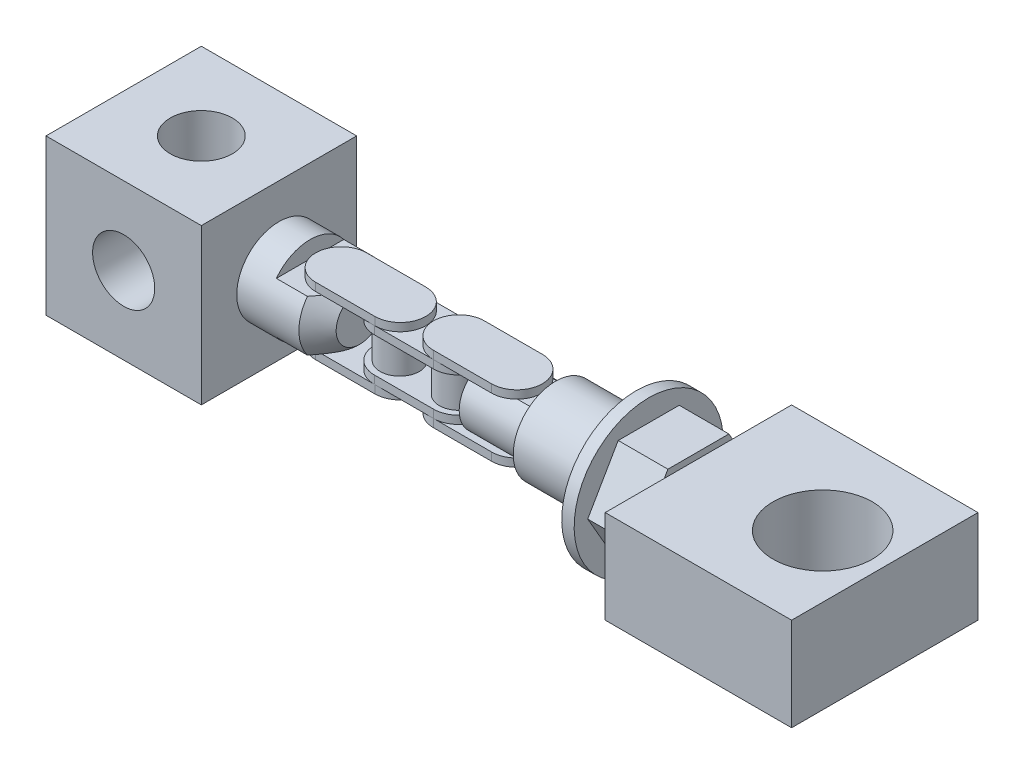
ISO-10303-21;
HEADER;
FILE_DESCRIPTION(('STEP AP214'),'2;1');
FILE_NAME('part.step','',(''),(''),'','','');
FILE_SCHEMA(('AUTOMOTIVE_DESIGN { 1 0 10303 214 1 1 1 1 }'));
ENDSEC;
DATA;
#1=APPLICATION_CONTEXT('core data for automotive mechanical design processes');
#2=APPLICATION_PROTOCOL_DEFINITION('international standard','automotive_design',2000,#1);
#3=PRODUCT_CONTEXT('',#1,'mechanical');
#4=PRODUCT('Part','Part','',(#3));
#5=PRODUCT_RELATED_PRODUCT_CATEGORY('part','',(#4));
#6=PRODUCT_DEFINITION_FORMATION('','',#4);
#7=PRODUCT_DEFINITION_CONTEXT('part definition',#1,'design');
#8=PRODUCT_DEFINITION('design','',#6,#7);
#9=PRODUCT_DEFINITION_SHAPE('','',#8);
#10=(LENGTH_UNIT() NAMED_UNIT(*) SI_UNIT(.MILLI.,.METRE.));
#11=(NAMED_UNIT(*) PLANE_ANGLE_UNIT() SI_UNIT($,.RADIAN.));
#12=(NAMED_UNIT(*) SI_UNIT($,.STERADIAN.) SOLID_ANGLE_UNIT());
#13=UNCERTAINTY_MEASURE_WITH_UNIT(LENGTH_MEASURE(1.E-05),#10,'distance_accuracy_value','');
#14=(GEOMETRIC_REPRESENTATION_CONTEXT(3) GLOBAL_UNCERTAINTY_ASSIGNED_CONTEXT((#13)) GLOBAL_UNIT_ASSIGNED_CONTEXT((#10,
#11,#12)) REPRESENTATION_CONTEXT('',''));
#15=CARTESIAN_POINT('',(0.,0.,0.));
#16=DIRECTION('',(0.,0.,1.));
#17=DIRECTION('',(1.,0.,0.));
#18=AXIS2_PLACEMENT_3D('',#15,#16,#17);
#19=CARTESIAN_POINT('',(56.5,4.1,27.5));
#20=DIRECTION('',(0.,-1.,0.));
#21=DIRECTION('',(-1.,0.,0.));
#22=AXIS2_PLACEMENT_3D('',#19,#20,#21);
#23=PLANE('',#22);
#24=CARTESIAN_POINT('',(50.7951173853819,4.1,12.5));
#25=DIRECTION('',(0.,1.,0.));
#26=DIRECTION('',(0.,0.,-1.));
#27=AXIS2_PLACEMENT_3D('',#24,#25,#26);
#28=CIRCLE('',#27,4.1);
#29=CARTESIAN_POINT('',(53.7311010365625,4.1,15.3618176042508));
#30=VERTEX_POINT('',#29);
#31=CARTESIAN_POINT('',(53.7311010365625,4.1,9.63818239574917));
#32=VERTEX_POINT('',#31);
#33=EDGE_CURVE('E29',#30,#32,#28,.T.);
#34=ORIENTED_EDGE('',*,*,#33,.F.);
#35=DIRECTION('',(1.,0.,0.));
#36=VECTOR('',#35,1.);
#37=CARTESIAN_POINT('',(46.5,4.1,15.3618176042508));
#38=LINE('',#37,#36);
#39=CARTESIAN_POINT('',(56.5,4.1,15.3618176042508));
#40=VERTEX_POINT('',#39);
#41=EDGE_CURVE('E384',#40,#30,#38,.F.);
#42=ORIENTED_EDGE('',*,*,#41,.F.);
#43=DIRECTION('',(0.,0.,-1.));
#44=VECTOR('',#43,1.);
#45=CARTESIAN_POINT('',(56.5,4.1,27.5));
#46=LINE('',#45,#44);
#47=CARTESIAN_POINT('',(56.5,4.1,9.63818239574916));
#48=VERTEX_POINT('',#47);
#49=EDGE_CURVE('E381',#40,#48,#46,.T.);
#50=ORIENTED_EDGE('',*,*,#49,.T.);
#51=DIRECTION('',(1.,0.,0.));
#52=VECTOR('',#51,1.);
#53=CARTESIAN_POINT('',(46.5,4.1,9.63818239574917));
#54=LINE('',#53,#52);
#55=EDGE_CURVE('E386',#32,#48,#54,.T.);
#56=ORIENTED_EDGE('',*,*,#55,.F.);
#57=EDGE_LOOP('',(#34,#42,#50,#56));
#58=FACE_BOUND('',#57,.T.);
#59=ADVANCED_FACE('F14',(#58),#23,.F.);
#60=CARTESIAN_POINT('',(57.,0.,12.5));
#61=DIRECTION('',(-1.,0.,0.));
#62=DIRECTION('',(0.,1.,0.));
#63=AXIS2_PLACEMENT_3D('',#60,#61,#62);
#64=PLANE('',#63);
#65=CARTESIAN_POINT('',(57.,0.,12.5));
#66=DIRECTION('',(-1.,0.,0.));
#67=DIRECTION('',(0.,1.,0.));
#68=AXIS2_PLACEMENT_3D('',#65,#66,#67);
#69=CIRCLE('',#68,6.8);
#70=CARTESIAN_POINT('',(57.,6.8,12.5));
#71=VERTEX_POINT('',#70);
#72=EDGE_CURVE('E397',#71,#71,#69,.T.);
#73=ORIENTED_EDGE('',*,*,#72,.T.);
#74=EDGE_LOOP('',(#73));
#75=FACE_BOUND('',#74,.T.);
#76=CARTESIAN_POINT('',(57.,0.,12.5));
#77=DIRECTION('',(-1.,0.,0.));
#78=DIRECTION('',(0.,1.,0.));
#79=AXIS2_PLACEMENT_3D('',#76,#77,#78);
#80=CIRCLE('',#79,5.);
#81=CARTESIAN_POINT('',(57.,5.,12.5));
#82=VERTEX_POINT('',#81);
#83=EDGE_CURVE('E389',#82,#82,#80,.T.);
#84=ORIENTED_EDGE('',*,*,#83,.F.);
#85=EDGE_LOOP('',(#84));
#86=FACE_BOUND('',#85,.T.);
#87=ADVANCED_FACE('F851',(#75,#86),#64,.T.);
#88=CARTESIAN_POINT('',(70.,0.,12.5));
#89=DIRECTION('',(-1.,0.,0.));
#90=DIRECTION('',(0.,1.,0.));
#91=AXIS2_PLACEMENT_3D('',#88,#89,#90);
#92=PLANE('',#91);
#93=CARTESIAN_POINT('',(70.,0.,12.5));
#94=DIRECTION('',(-1.,0.,0.));
#95=DIRECTION('',(0.,1.,0.));
#96=AXIS2_PLACEMENT_3D('',#93,#94,#95);
#97=CIRCLE('',#96,12.);
#98=CARTESIAN_POINT('',(70.,12.,12.5));
#99=VERTEX_POINT('',#98);
#100=EDGE_CURVE('E403',#99,#99,#97,.T.);
#101=ORIENTED_EDGE('',*,*,#100,.T.);
#102=EDGE_LOOP('',(#101));
#103=FACE_BOUND('',#102,.T.);
#104=CARTESIAN_POINT('',(70.,0.,12.5));
#105=DIRECTION('',(-1.,0.,0.));
#106=DIRECTION('',(0.,1.,0.));
#107=AXIS2_PLACEMENT_3D('',#104,#105,#106);
#108=CIRCLE('',#107,6.8);
#109=CARTESIAN_POINT('',(70.,6.8,12.5));
#110=VERTEX_POINT('',#109);
#111=EDGE_CURVE('E393',#110,#110,#108,.T.);
#112=ORIENTED_EDGE('',*,*,#111,.F.);
#113=EDGE_LOOP('',(#112));
#114=FACE_BOUND('',#113,.T.);
#115=ADVANCED_FACE('F857',(#103,#114),#92,.T.);
#116=CARTESIAN_POINT('',(80.,-7.5,27.5));
#117=DIRECTION('',(1.,0.,0.));
#118=DIRECTION('',(0.,-1.,0.));
#119=AXIS2_PLACEMENT_3D('',#116,#117,#118);
#120=PLANE('',#119);
#121=DIRECTION('',(0.,0.866025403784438,-0.5));
#122=VECTOR('',#121,1.);
#123=CARTESIAN_POINT('',(80.,0.,22.3149545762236));
#124=LINE('',#123,#122);
#125=CARTESIAN_POINT('',(80.,0.,22.3149545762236));
#126=VERTEX_POINT('',#125);
#127=CARTESIAN_POINT('',(80.,7.5,17.9848275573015));
#128=VERTEX_POINT('',#127);
#129=EDGE_CURVE('E443',#126,#128,#124,.T.);
#130=ORIENTED_EDGE('',*,*,#129,.F.);
#131=DIRECTION('',(0.,0.866025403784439,0.5));
#132=VECTOR('',#131,1.);
#133=CARTESIAN_POINT('',(80.,-8.5,17.4074772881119));
#134=LINE('',#133,#132);
#135=CARTESIAN_POINT('',(80.,-7.5,17.9848275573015));
#136=VERTEX_POINT('',#135);
#137=EDGE_CURVE('E442',#136,#126,#134,.T.);
#138=ORIENTED_EDGE('',*,*,#137,.F.);
#139=DIRECTION('',(0.,0.,-1.));
#140=VECTOR('',#139,1.);
#141=CARTESIAN_POINT('',(80.,-7.5,27.5));
#142=LINE('',#141,#140);
#143=CARTESIAN_POINT('',(80.,-7.5,27.5));
#144=VERTEX_POINT('',#143);
#145=EDGE_CURVE('E470',#144,#136,#142,.T.);
#146=ORIENTED_EDGE('',*,*,#145,.F.);
#147=DIRECTION('',(0.,1.,0.));
#148=VECTOR('',#147,1.);
#149=CARTESIAN_POINT('',(80.,-7.5,27.5));
#150=LINE('',#149,#148);
#151=CARTESIAN_POINT('',(80.,7.5,27.5));
#152=VERTEX_POINT('',#151);
#153=EDGE_CURVE('E497',#144,#152,#150,.T.);
#154=ORIENTED_EDGE('',*,*,#153,.T.);
#155=DIRECTION('',(0.,0.,-1.));
#156=VECTOR('',#155,1.);
#157=CARTESIAN_POINT('',(80.,7.5,27.5));
#158=LINE('',#157,#156);
#159=EDGE_CURVE('E482',#152,#128,#158,.T.);
#160=ORIENTED_EDGE('',*,*,#159,.T.);
#161=EDGE_LOOP('',(#130,#138,#146,#154,#160));
#162=FACE_BOUND('',#161,.T.);
#163=ADVANCED_FACE('F874',(#162),#120,.F.);
#164=DIRECTION('',(0.,-0.866025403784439,-0.5));
#165=VECTOR('',#164,1.);
#166=CARTESIAN_POINT('',(80.,8.5,7.59252271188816));
#167=LINE('',#166,#165);
#168=CARTESIAN_POINT('',(80.,7.5,7.01517244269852));
#169=VERTEX_POINT('',#168);
#170=CARTESIAN_POINT('',(80.,0.,2.68504542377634));
#171=VERTEX_POINT('',#170);
#172=EDGE_CURVE('E432',#169,#171,#167,.T.);
#173=ORIENTED_EDGE('',*,*,#172,.F.);
#174=CARTESIAN_POINT('',(80.,7.5,-2.5));
#175=VERTEX_POINT('',#174);
#176=EDGE_CURVE('E481',#169,#175,#158,.T.);
#177=ORIENTED_EDGE('',*,*,#176,.T.);
#178=DIRECTION('',(0.,1.,0.));
#179=VECTOR('',#178,1.);
#180=CARTESIAN_POINT('',(80.,-7.5,-2.5));
#181=LINE('',#180,#179);
#182=CARTESIAN_POINT('',(80.,-7.5,-2.5));
#183=VERTEX_POINT('',#182);
#184=EDGE_CURVE('E494',#183,#175,#181,.T.);
#185=ORIENTED_EDGE('',*,*,#184,.F.);
#186=CARTESIAN_POINT('',(80.,-7.5,7.01517244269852));
#187=VERTEX_POINT('',#186);
#188=EDGE_CURVE('E468',#187,#183,#142,.T.);
#189=ORIENTED_EDGE('',*,*,#188,.F.);
#190=DIRECTION('',(0.,-0.866025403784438,0.5));
#191=VECTOR('',#190,1.);
#192=CARTESIAN_POINT('',(80.,0.,2.68504542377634));
#193=LINE('',#192,#191);
#194=EDGE_CURVE('E433',#171,#187,#193,.T.);
#195=ORIENTED_EDGE('',*,*,#194,.F.);
#196=EDGE_LOOP('',(#173,#177,#185,#189,#195));
#197=FACE_BOUND('',#196,.T.);
#198=ADVANCED_FACE('F928',(#197),#120,.F.);
#199=CARTESIAN_POINT('',(110.,-7.5,27.5));
#200=DIRECTION('',(0.,0.,-1.));
#201=DIRECTION('',(1.,0.,0.));
#202=AXIS2_PLACEMENT_3D('',#199,#200,#201);
#203=PLANE('',#202);
#204=DIRECTION('',(-1.,0.,0.));
#205=VECTOR('',#204,1.);
#206=CARTESIAN_POINT('',(110.,7.5,27.5));
#207=LINE('',#206,#205);
#208=CARTESIAN_POINT('',(110.,7.5,27.5));
#209=VERTEX_POINT('',#208);
#210=EDGE_CURVE('E464',#209,#152,#207,.T.);
#211=ORIENTED_EDGE('',*,*,#210,.T.);
#212=ORIENTED_EDGE('',*,*,#153,.F.);
#213=DIRECTION('',(-1.,0.,0.));
#214=VECTOR('',#213,1.);
#215=CARTESIAN_POINT('',(110.,-7.5,27.5));
#216=LINE('',#215,#214);
#217=CARTESIAN_POINT('',(110.,-7.5,27.5));
#218=VERTEX_POINT('',#217);
#219=EDGE_CURVE('E465',#218,#144,#216,.T.);
#220=ORIENTED_EDGE('',*,*,#219,.F.);
#221=DIRECTION('',(0.,1.,0.));
#222=VECTOR('',#221,1.);
#223=CARTESIAN_POINT('',(110.,-7.5,27.5));
#224=LINE('',#223,#222);
#225=EDGE_CURVE('E478',#218,#209,#224,.T.);
#226=ORIENTED_EDGE('',*,*,#225,.T.);
#227=EDGE_LOOP('',(#211,#212,#220,#226));
#228=FACE_BOUND('',#227,.T.);
#229=ADVANCED_FACE('F16',(#228),#203,.F.);
#230=CARTESIAN_POINT('',(110.,-7.5,-2.5));
#231=DIRECTION('',(0.,0.,1.));
#232=DIRECTION('',(-1.,0.,0.));
#233=AXIS2_PLACEMENT_3D('',#230,#231,#232);
#234=PLANE('',#233);
#235=DIRECTION('',(1.,0.,0.));
#236=VECTOR('',#235,1.);
#237=CARTESIAN_POINT('',(110.,7.5,-2.5));
#238=LINE('',#237,#236);
#239=CARTESIAN_POINT('',(110.,7.5,-2.5));
#240=VERTEX_POINT('',#239);
#241=EDGE_CURVE('E485',#175,#240,#238,.T.);
#242=ORIENTED_EDGE('',*,*,#241,.T.);
#243=DIRECTION('',(0.,1.,0.));
#244=VECTOR('',#243,1.);
#245=CARTESIAN_POINT('',(110.,-7.5,-2.5));
#246=LINE('',#245,#244);
#247=CARTESIAN_POINT('',(110.,-7.5,-2.5));
#248=VERTEX_POINT('',#247);
#249=EDGE_CURVE('E491',#248,#240,#246,.T.);
#250=ORIENTED_EDGE('',*,*,#249,.F.);
#251=DIRECTION('',(1.,0.,0.));
#252=VECTOR('',#251,1.);
#253=CARTESIAN_POINT('',(110.,-7.5,-2.5));
#254=LINE('',#253,#252);
#255=EDGE_CURVE('E473',#183,#248,#254,.T.);
#256=ORIENTED_EDGE('',*,*,#255,.F.);
#257=ORIENTED_EDGE('',*,*,#184,.T.);
#258=EDGE_LOOP('',(#242,#250,#256,#257));
#259=FACE_BOUND('',#258,.T.);
#260=ADVANCED_FACE('F923',(#259),#234,.F.);
#261=CARTESIAN_POINT('',(110.,-7.5,27.5));
#262=DIRECTION('',(-1.,0.,0.));
#263=DIRECTION('',(0.,1.,0.));
#264=AXIS2_PLACEMENT_3D('',#261,#262,#263);
#265=PLANE('',#264);
#266=DIRECTION('',(0.,0.,1.));
#267=VECTOR('',#266,1.);
#268=CARTESIAN_POINT('',(110.,7.5,27.5));
#269=LINE('',#268,#267);
#270=EDGE_CURVE('E469',#240,#209,#269,.T.);
#271=ORIENTED_EDGE('',*,*,#270,.T.);
#272=ORIENTED_EDGE('',*,*,#225,.F.);
#273=DIRECTION('',(0.,0.,1.));
#274=VECTOR('',#273,1.);
#275=CARTESIAN_POINT('',(110.,-7.5,27.5));
#276=LINE('',#275,#274);
#277=EDGE_CURVE('E476',#248,#218,#276,.T.);
#278=ORIENTED_EDGE('',*,*,#277,.F.);
#279=ORIENTED_EDGE('',*,*,#249,.T.);
#280=EDGE_LOOP('',(#271,#272,#278,#279));
#281=FACE_BOUND('',#280,.T.);
#282=ADVANCED_FACE('F916',(#281),#265,.F.);
#283=CARTESIAN_POINT('',(80.,-7.5,27.5));
#284=DIRECTION('',(0.,-1.,0.));
#285=DIRECTION('',(0.,0.,-1.));
#286=AXIS2_PLACEMENT_3D('',#283,#284,#285);
#287=PLANE('',#286);
#288=CARTESIAN_POINT('',(100.,-7.5,12.5));
#289=DIRECTION('',(0.,-1.,0.));
#290=DIRECTION('',(0.,0.,-1.));
#291=AXIS2_PLACEMENT_3D('',#288,#289,#290);
#292=CIRCLE('',#291,8.);
#293=CARTESIAN_POINT('',(100.,-7.5,4.5));
#294=VERTEX_POINT('',#293);
#295=EDGE_CURVE('E365',#294,#294,#292,.T.);
#296=ORIENTED_EDGE('',*,*,#295,.F.);
#297=EDGE_LOOP('',(#296));
#298=FACE_BOUND('',#297,.T.);
#299=ORIENTED_EDGE('',*,*,#219,.T.);
#300=ORIENTED_EDGE('',*,*,#145,.T.);
#301=EDGE_CURVE('E474',#136,#187,#142,.T.);
#302=ORIENTED_EDGE('',*,*,#301,.T.);
#303=ORIENTED_EDGE('',*,*,#188,.T.);
#304=ORIENTED_EDGE('',*,*,#255,.T.);
#305=ORIENTED_EDGE('',*,*,#277,.T.);
#306=EDGE_LOOP('',(#299,#300,#302,#303,#304,#305));
#307=FACE_BOUND('',#306,.T.);
#308=ADVANCED_FACE('F912',(#298,#307),#287,.T.);
#309=CARTESIAN_POINT('',(80.,7.5,27.5));
#310=DIRECTION('',(0.,-1.,0.));
#311=DIRECTION('',(0.,0.,-1.));
#312=AXIS2_PLACEMENT_3D('',#309,#310,#311);
#313=PLANE('',#312);
#314=CARTESIAN_POINT('',(100.,7.5,12.5));
#315=DIRECTION('',(0.,-1.,0.));
#316=DIRECTION('',(0.,0.,-1.));
#317=AXIS2_PLACEMENT_3D('',#314,#315,#316);
#318=CIRCLE('',#317,8.);
#319=CARTESIAN_POINT('',(100.,7.5,4.5));
#320=VERTEX_POINT('',#319);
#321=EDGE_CURVE('E368',#320,#320,#318,.T.);
#322=ORIENTED_EDGE('',*,*,#321,.T.);
#323=EDGE_LOOP('',(#322));
#324=FACE_BOUND('',#323,.T.);
#325=ORIENTED_EDGE('',*,*,#210,.F.);
#326=ORIENTED_EDGE('',*,*,#270,.F.);
#327=ORIENTED_EDGE('',*,*,#241,.F.);
#328=ORIENTED_EDGE('',*,*,#176,.F.);
#329=EDGE_CURVE('E486',#128,#169,#158,.T.);
#330=ORIENTED_EDGE('',*,*,#329,.F.);
#331=ORIENTED_EDGE('',*,*,#159,.F.);
#332=EDGE_LOOP('',(#325,#326,#327,#328,#330,#331));
#333=FACE_BOUND('',#332,.T.);
#334=ADVANCED_FACE('F915',(#324,#333),#313,.F.);
#335=CARTESIAN_POINT('',(80.,0.,2.68504542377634));
#336=DIRECTION('',(-1.,0.,0.));
#337=DIRECTION('',(0.,1.,0.));
#338=AXIS2_PLACEMENT_3D('',#335,#336,#337);
#339=PLANE('',#338);
#340=CARTESIAN_POINT('',(80.,8.5,17.4074772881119));
#341=VERTEX_POINT('',#340);
#342=EDGE_CURVE('E441',#128,#341,#124,.T.);
#343=ORIENTED_EDGE('',*,*,#342,.F.);
#344=ORIENTED_EDGE('',*,*,#329,.T.);
#345=CARTESIAN_POINT('',(80.,8.5,7.59252271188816));
#346=VERTEX_POINT('',#345);
#347=EDGE_CURVE('E406',#346,#169,#167,.T.);
#348=ORIENTED_EDGE('',*,*,#347,.F.);
#349=DIRECTION('',(0.,0.,-1.));
#350=VECTOR('',#349,1.);
#351=CARTESIAN_POINT('',(80.,8.5,17.4074772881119));
#352=LINE('',#351,#350);
#353=EDGE_CURVE('E413',#341,#346,#352,.T.);
#354=ORIENTED_EDGE('',*,*,#353,.F.);
#355=EDGE_LOOP('',(#343,#344,#348,#354));
#356=FACE_BOUND('',#355,.T.);
#357=ADVANCED_FACE('F888',(#356),#339,.F.);
#358=CARTESIAN_POINT('',(72.,8.5,7.59252271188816));
#359=DIRECTION('',(0.,-0.5,0.866025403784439));
#360=DIRECTION('',(0.,-0.866025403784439,-0.5));
#361=AXIS2_PLACEMENT_3D('',#358,#359,#360);
#362=PLANE('',#361);
#363=ORIENTED_EDGE('',*,*,#347,.T.);
#364=ORIENTED_EDGE('',*,*,#172,.T.);
#365=DIRECTION('',(1.,0.,0.));
#366=VECTOR('',#365,1.);
#367=CARTESIAN_POINT('',(72.,0.,2.68504542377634));
#368=LINE('',#367,#366);
#369=CARTESIAN_POINT('',(72.,0.,2.68504542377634));
#370=VERTEX_POINT('',#369);
#371=EDGE_CURVE('E461',#370,#171,#368,.T.);
#372=ORIENTED_EDGE('',*,*,#371,.F.);
#373=DIRECTION('',(0.,-0.866025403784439,-0.5));
#374=VECTOR('',#373,1.);
#375=CARTESIAN_POINT('',(72.,8.5,7.59252271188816));
#376=LINE('',#375,#374);
#377=CARTESIAN_POINT('',(72.,8.5,7.59252271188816));
#378=VERTEX_POINT('',#377);
#379=EDGE_CURVE('E409',#378,#370,#376,.T.);
#380=ORIENTED_EDGE('',*,*,#379,.F.);
#381=DIRECTION('',(1.,0.,0.));
#382=VECTOR('',#381,1.);
#383=CARTESIAN_POINT('',(72.,8.5,7.59252271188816));
#384=LINE('',#383,#382);
#385=EDGE_CURVE('E428',#378,#346,#384,.T.);
#386=ORIENTED_EDGE('',*,*,#385,.T.);
#387=EDGE_LOOP('',(#363,#364,#372,#380,#386));
#388=FACE_BOUND('',#387,.T.);
#389=ADVANCED_FACE('F907',(#388),#362,.F.);
#390=CARTESIAN_POINT('',(72.,0.,2.68504542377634));
#391=DIRECTION('',(0.,0.5,0.866025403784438));
#392=DIRECTION('',(0.,-0.866025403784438,0.5));
#393=AXIS2_PLACEMENT_3D('',#390,#391,#392);
#394=PLANE('',#393);
#395=ORIENTED_EDGE('',*,*,#194,.T.);
#396=CARTESIAN_POINT('',(80.,-8.5,7.59252271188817));
#397=VERTEX_POINT('',#396);
#398=EDGE_CURVE('E431',#187,#397,#193,.T.);
#399=ORIENTED_EDGE('',*,*,#398,.T.);
#400=DIRECTION('',(1.,0.,0.));
#401=VECTOR('',#400,1.);
#402=CARTESIAN_POINT('',(72.,-8.5,7.59252271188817));
#403=LINE('',#402,#401);
#404=CARTESIAN_POINT('',(72.,-8.5,7.59252271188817));
#405=VERTEX_POINT('',#404);
#406=EDGE_CURVE('E458',#405,#397,#403,.T.);
#407=ORIENTED_EDGE('',*,*,#406,.F.);
#408=DIRECTION('',(0.,-0.866025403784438,0.5));
#409=VECTOR('',#408,1.);
#410=CARTESIAN_POINT('',(72.,0.,2.68504542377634));
#411=LINE('',#410,#409);
#412=EDGE_CURVE('E412',#370,#405,#411,.T.);
#413=ORIENTED_EDGE('',*,*,#412,.F.);
#414=ORIENTED_EDGE('',*,*,#371,.T.);
#415=EDGE_LOOP('',(#395,#399,#407,#413,#414));
#416=FACE_BOUND('',#415,.T.);
#417=ADVANCED_FACE('F903',(#416),#394,.F.);
#418=CARTESIAN_POINT('',(72.,-8.5,7.59252271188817));
#419=DIRECTION('',(0.,1.,0.));
#420=DIRECTION('',(0.,0.,1.));
#421=AXIS2_PLACEMENT_3D('',#418,#419,#420);
#422=PLANE('',#421);
#423=DIRECTION('',(0.,0.,1.));
#424=VECTOR('',#423,1.);
#425=CARTESIAN_POINT('',(80.,-8.5,7.59252271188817));
#426=LINE('',#425,#424);
#427=CARTESIAN_POINT('',(80.,-8.5,17.4074772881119));
#428=VERTEX_POINT('',#427);
#429=EDGE_CURVE('E436',#397,#428,#426,.T.);
#430=ORIENTED_EDGE('',*,*,#429,.T.);
#431=DIRECTION('',(1.,0.,0.));
#432=VECTOR('',#431,1.);
#433=CARTESIAN_POINT('',(72.,-8.5,17.4074772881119));
#434=LINE('',#433,#432);
#435=CARTESIAN_POINT('',(72.,-8.5,17.4074772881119));
#436=VERTEX_POINT('',#435);
#437=EDGE_CURVE('E455',#436,#428,#434,.T.);
#438=ORIENTED_EDGE('',*,*,#437,.F.);
#439=DIRECTION('',(0.,0.,1.));
#440=VECTOR('',#439,1.);
#441=CARTESIAN_POINT('',(72.,-8.5,7.59252271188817));
#442=LINE('',#441,#440);
#443=EDGE_CURVE('E416',#405,#436,#442,.T.);
#444=ORIENTED_EDGE('',*,*,#443,.F.);
#445=ORIENTED_EDGE('',*,*,#406,.T.);
#446=EDGE_LOOP('',(#430,#438,#444,#445));
#447=FACE_BOUND('',#446,.T.);
#448=ADVANCED_FACE('F899',(#447),#422,.F.);
#449=CARTESIAN_POINT('',(72.,-8.5,17.4074772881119));
#450=DIRECTION('',(0.,0.5,-0.866025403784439));
#451=DIRECTION('',(0.,0.866025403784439,0.5));
#452=AXIS2_PLACEMENT_3D('',#449,#450,#451);
#453=PLANE('',#452);
#454=EDGE_CURVE('E438',#428,#136,#134,.T.);
#455=ORIENTED_EDGE('',*,*,#454,.T.);
#456=ORIENTED_EDGE('',*,*,#137,.T.);
#457=DIRECTION('',(1.,0.,0.));
#458=VECTOR('',#457,1.);
#459=CARTESIAN_POINT('',(72.,0.,22.3149545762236));
#460=LINE('',#459,#458);
#461=CARTESIAN_POINT('',(72.,0.,22.3149545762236));
#462=VERTEX_POINT('',#461);
#463=EDGE_CURVE('E452',#462,#126,#460,.T.);
#464=ORIENTED_EDGE('',*,*,#463,.F.);
#465=DIRECTION('',(0.,0.866025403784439,0.5));
#466=VECTOR('',#465,1.);
#467=CARTESIAN_POINT('',(72.,-8.5,17.4074772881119));
#468=LINE('',#467,#466);
#469=EDGE_CURVE('E419',#436,#462,#468,.T.);
#470=ORIENTED_EDGE('',*,*,#469,.F.);
#471=ORIENTED_EDGE('',*,*,#437,.T.);
#472=EDGE_LOOP('',(#455,#456,#464,#470,#471));
#473=FACE_BOUND('',#472,.T.);
#474=ADVANCED_FACE('F895',(#473),#453,.F.);
#475=CARTESIAN_POINT('',(72.,0.,22.3149545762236));
#476=DIRECTION('',(0.,-0.5,-0.866025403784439));
#477=DIRECTION('',(0.,0.866025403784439,-0.5));
#478=AXIS2_PLACEMENT_3D('',#475,#476,#477);
#479=PLANE('',#478);
#480=ORIENTED_EDGE('',*,*,#129,.T.);
#481=ORIENTED_EDGE('',*,*,#342,.T.);
#482=DIRECTION('',(1.,0.,0.));
#483=VECTOR('',#482,1.);
#484=CARTESIAN_POINT('',(72.,8.5,17.4074772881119));
#485=LINE('',#484,#483);
#486=CARTESIAN_POINT('',(72.,8.5,17.4074772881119));
#487=VERTEX_POINT('',#486);
#488=EDGE_CURVE('E449',#487,#341,#485,.T.);
#489=ORIENTED_EDGE('',*,*,#488,.F.);
#490=DIRECTION('',(0.,0.866025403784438,-0.5));
#491=VECTOR('',#490,1.);
#492=CARTESIAN_POINT('',(72.,0.,22.3149545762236));
#493=LINE('',#492,#491);
#494=EDGE_CURVE('E422',#462,#487,#493,.T.);
#495=ORIENTED_EDGE('',*,*,#494,.F.);
#496=ORIENTED_EDGE('',*,*,#463,.T.);
#497=EDGE_LOOP('',(#480,#481,#489,#495,#496));
#498=FACE_BOUND('',#497,.T.);
#499=ADVANCED_FACE('F891',(#498),#479,.F.);
#500=CARTESIAN_POINT('',(72.,8.5,17.4074772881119));
#501=DIRECTION('',(0.,-1.,0.));
#502=DIRECTION('',(0.,0.,-1.));
#503=AXIS2_PLACEMENT_3D('',#500,#501,#502);
#504=PLANE('',#503);
#505=ORIENTED_EDGE('',*,*,#353,.T.);
#506=ORIENTED_EDGE('',*,*,#385,.F.);
#507=DIRECTION('',(0.,0.,-1.));
#508=VECTOR('',#507,1.);
#509=CARTESIAN_POINT('',(72.,8.5,17.4074772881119));
#510=LINE('',#509,#508);
#511=EDGE_CURVE('E425',#487,#378,#510,.T.);
#512=ORIENTED_EDGE('',*,*,#511,.F.);
#513=ORIENTED_EDGE('',*,*,#488,.T.);
#514=EDGE_LOOP('',(#505,#506,#512,#513));
#515=FACE_BOUND('',#514,.T.);
#516=ADVANCED_FACE('F886',(#515),#504,.F.);
#517=ORIENTED_EDGE('',*,*,#301,.F.);
#518=ORIENTED_EDGE('',*,*,#454,.F.);
#519=ORIENTED_EDGE('',*,*,#429,.F.);
#520=ORIENTED_EDGE('',*,*,#398,.F.);
#521=EDGE_LOOP('',(#517,#518,#519,#520));
#522=FACE_BOUND('',#521,.T.);
#523=ADVANCED_FACE('F879',(#522),#339,.F.);
#524=CARTESIAN_POINT('',(72.,0.,12.5));
#525=DIRECTION('',(-1.,0.,0.));
#526=DIRECTION('',(0.,1.,0.));
#527=AXIS2_PLACEMENT_3D('',#524,#525,#526);
#528=PLANE('',#527);
#529=CARTESIAN_POINT('',(72.,0.,12.5));
#530=DIRECTION('',(-1.,0.,0.));
#531=DIRECTION('',(0.,1.,0.));
#532=AXIS2_PLACEMENT_3D('',#529,#530,#531);
#533=CIRCLE('',#532,12.);
#534=CARTESIAN_POINT('',(72.,12.,12.5));
#535=VERTEX_POINT('',#534);
#536=EDGE_CURVE('E400',#535,#535,#533,.T.);
#537=ORIENTED_EDGE('',*,*,#536,.F.);
#538=EDGE_LOOP('',(#537));
#539=FACE_BOUND('',#538,.T.);
#540=ORIENTED_EDGE('',*,*,#511,.T.);
#541=ORIENTED_EDGE('',*,*,#379,.T.);
#542=ORIENTED_EDGE('',*,*,#412,.T.);
#543=ORIENTED_EDGE('',*,*,#443,.T.);
#544=ORIENTED_EDGE('',*,*,#469,.T.);
#545=ORIENTED_EDGE('',*,*,#494,.T.);
#546=EDGE_LOOP('',(#540,#541,#542,#543,#544,#545));
#547=FACE_BOUND('',#546,.T.);
#548=ADVANCED_FACE('F876',(#539,#547),#528,.F.);
#549=CARTESIAN_POINT('',(70.,0.,12.5));
#550=DIRECTION('',(1.,0.,0.));
#551=DIRECTION('',(0.,-1.,0.));
#552=AXIS2_PLACEMENT_3D('',#549,#550,#551);
#553=CYLINDRICAL_SURFACE('',#552,12.);
#554=ORIENTED_EDGE('',*,*,#100,.F.);
#555=EDGE_LOOP('',(#554));
#556=FACE_BOUND('',#555,.T.);
#557=ORIENTED_EDGE('',*,*,#536,.T.);
#558=EDGE_LOOP('',(#557));
#559=FACE_BOUND('',#558,.T.);
#560=ADVANCED_FACE('F870',(#556,#559),#553,.T.);
#561=CARTESIAN_POINT('',(57.,0.,12.5));
#562=DIRECTION('',(1.,0.,0.));
#563=DIRECTION('',(0.,-1.,0.));
#564=AXIS2_PLACEMENT_3D('',#561,#562,#563);
#565=CYLINDRICAL_SURFACE('',#564,6.8);
#566=ORIENTED_EDGE('',*,*,#72,.F.);
#567=EDGE_LOOP('',(#566));
#568=FACE_BOUND('',#567,.T.);
#569=ORIENTED_EDGE('',*,*,#111,.T.);
#570=EDGE_LOOP('',(#569));
#571=FACE_BOUND('',#570,.T.);
#572=ADVANCED_FACE('F866',(#568,#571),#565,.T.);
#573=CARTESIAN_POINT('',(46.5,0.,12.5));
#574=DIRECTION('',(1.,0.,0.));
#575=DIRECTION('',(0.,-1.,0.));
#576=AXIS2_PLACEMENT_3D('',#573,#574,#575);
#577=CYLINDRICAL_SURFACE('',#576,5.);
#578=CARTESIAN_POINT('',(46.5,0.,12.5));
#579=DIRECTION('',(-1.,0.,0.));
#580=DIRECTION('',(0.,1.,0.));
#581=AXIS2_PLACEMENT_3D('',#578,#579,#580);
#582=CIRCLE('',#581,5.);
#583=CARTESIAN_POINT('',(46.5,-4.1,15.3618176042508));
#584=VERTEX_POINT('',#583);
#585=CARTESIAN_POINT('',(46.5,4.1,15.3618176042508));
#586=VERTEX_POINT('',#585);
#587=EDGE_CURVE('E394',#584,#586,#582,.T.);
#588=ORIENTED_EDGE('',*,*,#587,.F.);
#589=DIRECTION('',(1.,0.,0.));
#590=VECTOR('',#589,1.);
#591=CARTESIAN_POINT('',(46.5,-4.1,15.3618176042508));
#592=LINE('',#591,#590);
#593=CARTESIAN_POINT('',(53.7311010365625,-4.1,15.3618176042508));
#594=VERTEX_POINT('',#593);
#595=EDGE_CURVE('E378',#584,#594,#592,.T.);
#596=ORIENTED_EDGE('',*,*,#595,.T.);
#597=CARTESIAN_POINT('',(56.5,-4.1,15.3618176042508));
#598=VERTEX_POINT('',#597);
#599=EDGE_CURVE('E377',#594,#598,#592,.T.);
#600=ORIENTED_EDGE('',*,*,#599,.T.);
#601=CARTESIAN_POINT('',(56.5,0.,12.5));
#602=DIRECTION('',(1.,0.,0.));
#603=DIRECTION('',(0.,-1.,0.));
#604=AXIS2_PLACEMENT_3D('',#601,#602,#603);
#605=CIRCLE('',#604,5.);
#606=CARTESIAN_POINT('',(56.5,-4.1,9.63818239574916));
#607=VERTEX_POINT('',#606);
#608=EDGE_CURVE('E9',#598,#607,#605,.T.);
#609=ORIENTED_EDGE('',*,*,#608,.T.);
#610=DIRECTION('',(1.,0.,0.));
#611=VECTOR('',#610,1.);
#612=CARTESIAN_POINT('',(46.5,-4.1,9.63818239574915));
#613=LINE('',#612,#611);
#614=CARTESIAN_POINT('',(53.7311010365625,-4.1,9.63818239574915));
#615=VERTEX_POINT('',#614);
#616=EDGE_CURVE('E374',#607,#615,#613,.F.);
#617=ORIENTED_EDGE('',*,*,#616,.T.);
#618=DIRECTION('',(1.,0.,0.));
#619=VECTOR('',#618,1.);
#620=CARTESIAN_POINT('',(46.5,-4.1,9.63818239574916));
#621=LINE('',#620,#619);
#622=CARTESIAN_POINT('',(46.5,-4.1,9.63818239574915));
#623=VERTEX_POINT('',#622);
#624=EDGE_CURVE('E362',#615,#623,#621,.F.);
#625=ORIENTED_EDGE('',*,*,#624,.T.);
#626=CARTESIAN_POINT('',(46.5,4.1,9.63818239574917));
#627=VERTEX_POINT('',#626);
#628=EDGE_CURVE('E390',#627,#623,#582,.T.);
#629=ORIENTED_EDGE('',*,*,#628,.F.);
#630=EDGE_CURVE('E387',#627,#32,#54,.T.);
#631=ORIENTED_EDGE('',*,*,#630,.T.);
#632=ORIENTED_EDGE('',*,*,#55,.T.);
#633=CARTESIAN_POINT('',(56.5,0.,12.5));
#634=DIRECTION('',(1.,0.,0.));
#635=DIRECTION('',(0.,-1.,0.));
#636=AXIS2_PLACEMENT_3D('',#633,#634,#635);
#637=CIRCLE('',#636,5.);
#638=EDGE_CURVE('E503',#48,#40,#637,.T.);
#639=ORIENTED_EDGE('',*,*,#638,.T.);
#640=ORIENTED_EDGE('',*,*,#41,.T.);
#641=DIRECTION('',(1.,0.,0.));
#642=VECTOR('',#641,1.);
#643=CARTESIAN_POINT('',(46.5,4.1,15.3618176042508));
#644=LINE('',#643,#642);
#645=EDGE_CURVE('E355',#30,#586,#644,.F.);
#646=ORIENTED_EDGE('',*,*,#645,.T.);
#647=EDGE_LOOP('',(#588,#596,#600,#609,#617,#625,#629,#631,#632,#639,#640,#646));
#648=FACE_BOUND('',#647,.T.);
#649=ORIENTED_EDGE('',*,*,#83,.T.);
#650=EDGE_LOOP('',(#649));
#651=FACE_BOUND('',#650,.T.);
#652=ADVANCED_FACE('F515',(#648,#651),#577,.T.);
#653=CARTESIAN_POINT('',(46.5,0.,12.5));
#654=DIRECTION('',(-1.,0.,0.));
#655=DIRECTION('',(0.,1.,0.));
#656=AXIS2_PLACEMENT_3D('',#653,#654,#655);
#657=PLANE('',#656);
#658=DIRECTION('',(0.,0.,-1.));
#659=VECTOR('',#658,1.);
#660=CARTESIAN_POINT('',(46.5,-4.1,12.5));
#661=LINE('',#660,#659);
#662=EDGE_CURVE('E22',#584,#623,#661,.T.);
#663=ORIENTED_EDGE('',*,*,#662,.F.);
#664=ORIENTED_EDGE('',*,*,#587,.T.);
#665=DIRECTION('',(0.,0.,1.));
#666=VECTOR('',#665,1.);
#667=CARTESIAN_POINT('',(46.5,4.1,12.5));
#668=LINE('',#667,#666);
#669=EDGE_CURVE('E500',#627,#586,#668,.T.);
#670=ORIENTED_EDGE('',*,*,#669,.F.);
#671=ORIENTED_EDGE('',*,*,#628,.T.);
#672=EDGE_LOOP('',(#663,#664,#670,#671));
#673=FACE_BOUND('',#672,.T.);
#674=ADVANCED_FACE('F519',(#673),#657,.T.);
#675=CARTESIAN_POINT('',(56.5,4.1,27.5));
#676=DIRECTION('',(1.,0.,0.));
#677=DIRECTION('',(0.,-1.,0.));
#678=AXIS2_PLACEMENT_3D('',#675,#676,#677);
#679=PLANE('',#678);
#680=ORIENTED_EDGE('',*,*,#49,.F.);
#681=ORIENTED_EDGE('',*,*,#638,.F.);
#682=EDGE_LOOP('',(#680,#681));
#683=FACE_BOUND('',#682,.T.);
#684=ADVANCED_FACE('F531',(#683),#679,.F.);
#685=CARTESIAN_POINT('',(56.5,-4.1,27.5));
#686=DIRECTION('',(1.,0.,0.));
#687=DIRECTION('',(0.,-1.,0.));
#688=AXIS2_PLACEMENT_3D('',#685,#686,#687);
#689=PLANE('',#688);
#690=ORIENTED_EDGE('',*,*,#608,.F.);
#691=DIRECTION('',(0.,0.,-1.));
#692=VECTOR('',#691,1.);
#693=CARTESIAN_POINT('',(56.5,-4.1,27.5));
#694=LINE('',#693,#692);
#695=EDGE_CURVE('E371',#598,#607,#694,.T.);
#696=ORIENTED_EDGE('',*,*,#695,.T.);
#697=EDGE_LOOP('',(#690,#696));
#698=FACE_BOUND('',#697,.T.);
#699=ADVANCED_FACE('F537',(#698),#689,.F.);
#700=CARTESIAN_POINT('',(56.5,-4.1,27.5));
#701=DIRECTION('',(0.,1.,0.));
#702=DIRECTION('',(1.,0.,0.));
#703=AXIS2_PLACEMENT_3D('',#700,#701,#702);
#704=PLANE('',#703);
#705=ORIENTED_EDGE('',*,*,#599,.F.);
#706=CARTESIAN_POINT('',(50.7951173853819,-4.1,12.5));
#707=DIRECTION('',(0.,1.,0.));
#708=DIRECTION('',(0.,0.,-1.));
#709=AXIS2_PLACEMENT_3D('',#706,#707,#708);
#710=CIRCLE('',#709,4.1);
#711=EDGE_CURVE('E539',#594,#615,#710,.T.);
#712=ORIENTED_EDGE('',*,*,#711,.T.);
#713=ORIENTED_EDGE('',*,*,#616,.F.);
#714=ORIENTED_EDGE('',*,*,#695,.F.);
#715=EDGE_LOOP('',(#705,#712,#713,#714));
#716=FACE_BOUND('',#715,.T.);
#717=ADVANCED_FACE('F538',(#716),#704,.F.);
#718=CARTESIAN_POINT('',(100.,-7.5,12.5));
#719=DIRECTION('',(0.,-1.,0.));
#720=DIRECTION('',(0.,0.,-1.));
#721=AXIS2_PLACEMENT_3D('',#718,#719,#720);
#722=CYLINDRICAL_SURFACE('',#721,8.);
#723=ORIENTED_EDGE('',*,*,#295,.T.);
#724=EDGE_LOOP('',(#723));
#725=FACE_BOUND('',#724,.T.);
#726=ORIENTED_EDGE('',*,*,#321,.F.);
#727=EDGE_LOOP('',(#726));
#728=FACE_BOUND('',#727,.T.);
#729=ADVANCED_FACE('F1062',(#725,#728),#722,.F.);
#730=CARTESIAN_POINT('',(50.7951173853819,-4.1,12.5));
#731=DIRECTION('',(0.,1.,0.));
#732=DIRECTION('',(0.,0.,-1.));
#733=AXIS2_PLACEMENT_3D('',#730,#731,#732);
#734=PLANE('',#733);
#735=ORIENTED_EDGE('',*,*,#595,.F.);
#736=ORIENTED_EDGE('',*,*,#662,.T.);
#737=ORIENTED_EDGE('',*,*,#624,.F.);
#738=CARTESIAN_POINT('',(50.7951173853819,-4.1,8.4));
#739=VERTEX_POINT('',#738);
#740=EDGE_CURVE('E37',#615,#739,#710,.T.);
#741=ORIENTED_EDGE('',*,*,#740,.T.);
#742=DIRECTION('',(-1.,0.,0.));
#743=VECTOR('',#742,1.);
#744=CARTESIAN_POINT('',(50.7951173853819,-4.1,8.4));
#745=LINE('',#744,#743);
#746=CARTESIAN_POINT('',(41.4628840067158,-4.1,8.4));
#747=VERTEX_POINT('',#746);
#748=EDGE_CURVE('E553',#739,#747,#745,.T.);
#749=ORIENTED_EDGE('',*,*,#748,.T.);
#750=CARTESIAN_POINT('',(41.4628840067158,-4.1,12.5));
#751=DIRECTION('',(0.,-1.,0.));
#752=DIRECTION('',(0.,0.,1.));
#753=AXIS2_PLACEMENT_3D('',#750,#751,#752);
#754=CIRCLE('',#753,4.1);
#755=CARTESIAN_POINT('',(41.4628840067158,-4.1,16.6));
#756=VERTEX_POINT('',#755);
#757=EDGE_CURVE('E567',#747,#756,#754,.T.);
#758=ORIENTED_EDGE('',*,*,#757,.T.);
#759=DIRECTION('',(1.,0.,0.));
#760=VECTOR('',#759,1.);
#761=CARTESIAN_POINT('',(50.7951173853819,-4.1,16.6));
#762=LINE('',#761,#760);
#763=CARTESIAN_POINT('',(50.7951173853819,-4.1,16.6));
#764=VERTEX_POINT('',#763);
#765=EDGE_CURVE('E543',#756,#764,#762,.T.);
#766=ORIENTED_EDGE('',*,*,#765,.T.);
#767=EDGE_CURVE('E541',#764,#594,#710,.T.);
#768=ORIENTED_EDGE('',*,*,#767,.T.);
#769=EDGE_LOOP('',(#735,#736,#737,#741,#749,#758,#766,#768));
#770=FACE_BOUND('',#769,.T.);
#771=ADVANCED_FACE('F507',(#770),#734,.T.);
#772=CARTESIAN_POINT('',(50.7951173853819,4.1,12.5));
#773=DIRECTION('',(0.,-1.,0.));
#774=DIRECTION('',(0.,0.,-1.));
#775=AXIS2_PLACEMENT_3D('',#772,#773,#774);
#776=PLANE('',#775);
#777=ORIENTED_EDGE('',*,*,#630,.F.);
#778=ORIENTED_EDGE('',*,*,#669,.T.);
#779=ORIENTED_EDGE('',*,*,#645,.F.);
#780=CARTESIAN_POINT('',(50.7951173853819,4.1,16.6));
#781=VERTEX_POINT('',#780);
#782=EDGE_CURVE('E647',#781,#30,#28,.T.);
#783=ORIENTED_EDGE('',*,*,#782,.F.);
#784=DIRECTION('',(1.,0.,0.));
#785=VECTOR('',#784,1.);
#786=CARTESIAN_POINT('',(50.7951173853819,4.1,16.6));
#787=LINE('',#786,#785);
#788=CARTESIAN_POINT('',(41.4628840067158,4.1,16.6));
#789=VERTEX_POINT('',#788);
#790=EDGE_CURVE('E640',#789,#781,#787,.T.);
#791=ORIENTED_EDGE('',*,*,#790,.F.);
#792=CARTESIAN_POINT('',(41.4628840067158,4.1,12.5));
#793=DIRECTION('',(0.,-1.,0.));
#794=DIRECTION('',(0.,0.,1.));
#795=AXIS2_PLACEMENT_3D('',#792,#793,#794);
#796=CIRCLE('',#795,4.1);
#797=CARTESIAN_POINT('',(41.4628840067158,4.1,8.4));
#798=VERTEX_POINT('',#797);
#799=EDGE_CURVE('E667',#798,#789,#796,.T.);
#800=ORIENTED_EDGE('',*,*,#799,.F.);
#801=DIRECTION('',(-1.,0.,0.));
#802=VECTOR('',#801,1.);
#803=CARTESIAN_POINT('',(50.7951173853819,4.1,8.4));
#804=LINE('',#803,#802);
#805=CARTESIAN_POINT('',(50.7951173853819,4.1,8.4));
#806=VERTEX_POINT('',#805);
#807=EDGE_CURVE('E649',#806,#798,#804,.T.);
#808=ORIENTED_EDGE('',*,*,#807,.F.);
#809=EDGE_CURVE('E527',#32,#806,#28,.T.);
#810=ORIENTED_EDGE('',*,*,#809,.F.);
#811=EDGE_LOOP('',(#777,#778,#779,#783,#791,#800,#808,#810));
#812=FACE_BOUND('',#811,.T.);
#813=ADVANCED_FACE('F522',(#812),#776,.T.);
#814=CARTESIAN_POINT('',(0.,-12.5,12.5));
#815=DIRECTION('',(0.,-1.,0.));
#816=DIRECTION('',(0.,0.,-1.));
#817=AXIS2_PLACEMENT_3D('',#814,#815,#816);
#818=CYLINDRICAL_SURFACE('',#817,5.);
#819=CARTESIAN_POINT('',(0.,-12.5,12.5));
#820=DIRECTION('',(0.,-1.,0.));
#821=DIRECTION('',(0.,0.,-1.));
#822=AXIS2_PLACEMENT_3D('',#819,#820,#821);
#823=CIRCLE('',#822,5.);
#824=CARTESIAN_POINT('',(0.,-12.5,7.5));
#825=VERTEX_POINT('',#824);
#826=EDGE_CURVE('E1707',#825,#825,#823,.T.);
#827=ORIENTED_EDGE('',*,*,#826,.T.);
#828=EDGE_LOOP('',(#827));
#829=FACE_BOUND('',#828,.T.);
#830=CARTESIAN_POINT('',(0.,0.,12.5));
#831=DIRECTION('',(0.,-0.707106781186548,0.707106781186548));
#832=DIRECTION('',(0.,-0.707106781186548,-0.707106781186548));
#833=AXIS2_PLACEMENT_3D('',#830,#831,#832);
#834=ELLIPSE('',#833,7.07106781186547,5.);
#835=CARTESIAN_POINT('',(5.,0.,12.5));
#836=VERTEX_POINT('',#835);
#837=CARTESIAN_POINT('',(-5.,0.,12.5));
#838=VERTEX_POINT('',#837);
#839=EDGE_CURVE('E346',#836,#838,#834,.F.);
#840=ORIENTED_EDGE('',*,*,#839,.T.);
#841=CARTESIAN_POINT('',(0.,0.,12.5));
#842=DIRECTION('',(0.,-0.707106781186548,-0.707106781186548));
#843=DIRECTION('',(0.,-0.707106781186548,0.707106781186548));
#844=AXIS2_PLACEMENT_3D('',#841,#842,#843);
#845=ELLIPSE('',#844,7.07106781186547,5.);
#846=EDGE_CURVE('E342',#838,#836,#845,.F.);
#847=ORIENTED_EDGE('',*,*,#846,.T.);
#848=EDGE_LOOP('',(#840,#847));
#849=FACE_BOUND('',#848,.T.);
#850=ADVANCED_FACE('F354',(#829,#849),#818,.F.);
#851=CARTESIAN_POINT('',(41.4628840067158,2.8,12.5));
#852=DIRECTION('',(0.,1.,0.));
#853=DIRECTION('',(0.,0.,1.));
#854=AXIS2_PLACEMENT_3D('',#851,#852,#853);
#855=PLANE('',#854);
#856=CARTESIAN_POINT('',(31.9378840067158,2.79999999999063,12.5));
#857=DIRECTION('',(0.,1.,0.));
#858=DIRECTION('',(0.,0.,1.));
#859=AXIS2_PLACEMENT_3D('',#856,#857,#858);
#860=CIRCLE('',#859,3.15);
#861=CARTESIAN_POINT('',(31.9378840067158,2.79999999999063,15.65));
#862=VERTEX_POINT('',#861);
#863=EDGE_CURVE('E1626',#862,#862,#860,.F.);
#864=ORIENTED_EDGE('',*,*,#863,.F.);
#865=EDGE_LOOP('',(#864));
#866=FACE_BOUND('',#865,.T.);
#867=CARTESIAN_POINT('',(41.4628840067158,2.8,12.5));
#868=DIRECTION('',(0.,-1.,0.));
#869=DIRECTION('',(0.,0.,1.));
#870=AXIS2_PLACEMENT_3D('',#867,#868,#869);
#871=CIRCLE('',#870,4.1);
#872=CARTESIAN_POINT('',(41.4628840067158,2.8,8.4));
#873=VERTEX_POINT('',#872);
#874=CARTESIAN_POINT('',(41.4628840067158,2.8,16.6));
#875=VERTEX_POINT('',#874);
#876=EDGE_CURVE('E668',#873,#875,#871,.T.);
#877=ORIENTED_EDGE('',*,*,#876,.T.);
#878=DIRECTION('',(-1.,0.,0.));
#879=VECTOR('',#878,1.);
#880=CARTESIAN_POINT('',(41.4628840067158,2.8,16.6));
#881=LINE('',#880,#879);
#882=CARTESIAN_POINT('',(31.9378840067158,2.8,16.6));
#883=VERTEX_POINT('',#882);
#884=EDGE_CURVE('E671',#875,#883,#881,.T.);
#885=ORIENTED_EDGE('',*,*,#884,.T.);
#886=CARTESIAN_POINT('',(31.9378840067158,2.8,12.5));
#887=DIRECTION('',(0.,-1.,0.));
#888=DIRECTION('',(0.,0.,-1.));
#889=AXIS2_PLACEMENT_3D('',#886,#887,#888);
#890=CIRCLE('',#889,4.1);
#891=CARTESIAN_POINT('',(31.9378840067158,2.8,8.4));
#892=VERTEX_POINT('',#891);
#893=EDGE_CURVE('E674',#883,#892,#890,.T.);
#894=ORIENTED_EDGE('',*,*,#893,.T.);
#895=DIRECTION('',(1.,0.,0.));
#896=VECTOR('',#895,1.);
#897=CARTESIAN_POINT('',(41.4628840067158,2.8,8.4));
#898=LINE('',#897,#896);
#899=EDGE_CURVE('E676',#892,#873,#898,.T.);
#900=ORIENTED_EDGE('',*,*,#899,.T.);
#901=EDGE_LOOP('',(#877,#885,#894,#900));
#902=FACE_BOUND('',#901,.T.);
#903=CARTESIAN_POINT('',(41.4628840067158,2.79999999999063,12.5));
#904=DIRECTION('',(0.,1.,0.));
#905=DIRECTION('',(0.,0.,1.));
#906=AXIS2_PLACEMENT_3D('',#903,#904,#905);
#907=CIRCLE('',#906,3.15);
#908=CARTESIAN_POINT('',(41.4628840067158,2.79999999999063,15.65));
#909=VERTEX_POINT('',#908);
#910=EDGE_CURVE('E352',#909,#909,#907,.F.);
#911=ORIENTED_EDGE('',*,*,#910,.F.);
#912=EDGE_LOOP('',(#911));
#913=FACE_BOUND('',#912,.T.);
#914=ADVANCED_FACE('F1091',(#866,#902,#913),#855,.F.);
#915=CARTESIAN_POINT('',(41.4628840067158,-2.8,12.5));
#916=DIRECTION('',(0.,-1.,0.));
#917=DIRECTION('',(0.,0.,1.));
#918=AXIS2_PLACEMENT_3D('',#915,#916,#917);
#919=PLANE('',#918);
#920=CARTESIAN_POINT('',(31.9378840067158,-2.80000000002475,12.5));
#921=DIRECTION('',(0.,-1.,0.));
#922=DIRECTION('',(0.,0.,-1.));
#923=AXIS2_PLACEMENT_3D('',#920,#921,#922);
#924=CIRCLE('',#923,3.15);
#925=CARTESIAN_POINT('',(31.9378840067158,-2.80000000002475,9.35));
#926=VERTEX_POINT('',#925);
#927=EDGE_CURVE('E1623',#926,#926,#924,.F.);
#928=ORIENTED_EDGE('',*,*,#927,.F.);
#929=EDGE_LOOP('',(#928));
#930=FACE_BOUND('',#929,.T.);
#931=CARTESIAN_POINT('',(41.4628840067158,-2.8,12.5));
#932=DIRECTION('',(0.,-1.,0.));
#933=DIRECTION('',(0.,0.,1.));
#934=AXIS2_PLACEMENT_3D('',#931,#932,#933);
#935=CIRCLE('',#934,4.1);
#936=CARTESIAN_POINT('',(41.4628840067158,-2.8,8.4));
#937=VERTEX_POINT('',#936);
#938=CARTESIAN_POINT('',(41.4628840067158,-2.8,16.6));
#939=VERTEX_POINT('',#938);
#940=EDGE_CURVE('E568',#937,#939,#935,.T.);
#941=ORIENTED_EDGE('',*,*,#940,.F.);
#942=DIRECTION('',(1.,0.,0.));
#943=VECTOR('',#942,1.);
#944=CARTESIAN_POINT('',(41.4628840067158,-2.8,8.4));
#945=LINE('',#944,#943);
#946=CARTESIAN_POINT('',(31.9378840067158,-2.8,8.4));
#947=VERTEX_POINT('',#946);
#948=EDGE_CURVE('E571',#947,#937,#945,.T.);
#949=ORIENTED_EDGE('',*,*,#948,.F.);
#950=CARTESIAN_POINT('',(31.9378840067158,-2.8,12.5));
#951=DIRECTION('',(0.,-1.,0.));
#952=DIRECTION('',(0.,0.,-1.));
#953=AXIS2_PLACEMENT_3D('',#950,#951,#952);
#954=CIRCLE('',#953,4.1);
#955=CARTESIAN_POINT('',(31.9378840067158,-2.8,16.6));
#956=VERTEX_POINT('',#955);
#957=EDGE_CURVE('E575',#956,#947,#954,.T.);
#958=ORIENTED_EDGE('',*,*,#957,.F.);
#959=DIRECTION('',(-1.,0.,0.));
#960=VECTOR('',#959,1.);
#961=CARTESIAN_POINT('',(41.4628840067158,-2.8,16.6));
#962=LINE('',#961,#960);
#963=EDGE_CURVE('E578',#939,#956,#962,.T.);
#964=ORIENTED_EDGE('',*,*,#963,.F.);
#965=EDGE_LOOP('',(#941,#949,#958,#964));
#966=FACE_BOUND('',#965,.T.);
#967=CARTESIAN_POINT('',(41.4628840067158,-2.80000000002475,12.5));
#968=DIRECTION('',(0.,-1.,0.));
#969=DIRECTION('',(0.,0.,-1.));
#970=AXIS2_PLACEMENT_3D('',#967,#968,#969);
#971=CIRCLE('',#970,3.15);
#972=CARTESIAN_POINT('',(41.4628840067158,-2.80000000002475,9.35));
#973=VERTEX_POINT('',#972);
#974=EDGE_CURVE('E1629',#973,#973,#971,.F.);
#975=ORIENTED_EDGE('',*,*,#974,.F.);
#976=EDGE_LOOP('',(#975));
#977=FACE_BOUND('',#976,.T.);
#978=ADVANCED_FACE('F1100',(#930,#966,#977),#919,.F.);
#979=CARTESIAN_POINT('',(41.4628840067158,4.1,12.5));
#980=DIRECTION('',(0.,1.,0.));
#981=DIRECTION('',(0.,0.,1.));
#982=AXIS2_PLACEMENT_3D('',#979,#980,#981);
#983=PLANE('',#982);
#984=DIRECTION('',(-1.,0.,0.));
#985=VECTOR('',#984,1.);
#986=CARTESIAN_POINT('',(41.4628840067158,4.1,16.6));
#987=LINE('',#986,#985);
#988=CARTESIAN_POINT('',(32.025,4.1,16.6));
#989=VERTEX_POINT('',#988);
#990=EDGE_CURVE('E681',#789,#989,#987,.T.);
#991=ORIENTED_EDGE('',*,*,#990,.F.);
#992=CARTESIAN_POINT('',(41.4628840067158,4.1,12.5));
#993=DIRECTION('',(0.,1.,0.));
#994=DIRECTION('',(0.,0.,1.));
#995=AXIS2_PLACEMENT_3D('',#992,#993,#994);
#996=CIRCLE('',#995,4.1);
#997=EDGE_CURVE('E652',#798,#789,#996,.T.);
#998=ORIENTED_EDGE('',*,*,#997,.F.);
#999=DIRECTION('',(1.,0.,0.));
#1000=VECTOR('',#999,1.);
#1001=CARTESIAN_POINT('',(41.4628840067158,4.1,8.4));
#1002=LINE('',#1001,#1000);
#1003=CARTESIAN_POINT('',(32.025,4.1,8.4));
#1004=VERTEX_POINT('',#1003);
#1005=EDGE_CURVE('E672',#1004,#798,#1002,.T.);
#1006=ORIENTED_EDGE('',*,*,#1005,.F.);
#1007=CARTESIAN_POINT('',(32.025,4.1,12.5));
#1008=DIRECTION('',(0.,1.,0.));
#1009=DIRECTION('',(1.,0.,0.));
#1010=AXIS2_PLACEMENT_3D('',#1007,#1008,#1009);
#1011=CIRCLE('',#1010,4.1);
#1012=EDGE_CURVE('E698',#989,#1004,#1011,.T.);
#1013=ORIENTED_EDGE('',*,*,#1012,.F.);
#1014=EDGE_LOOP('',(#991,#998,#1006,#1013));
#1015=FACE_BOUND('',#1014,.T.);
#1016=ADVANCED_FACE('F1109',(#1015),#983,.T.);
#1017=CARTESIAN_POINT('',(32.025,4.1,12.5));
#1018=DIRECTION('',(0.,1.,0.));
#1019=DIRECTION('',(1.,0.,0.));
#1020=AXIS2_PLACEMENT_3D('',#1017,#1018,#1019);
#1021=PLANE('',#1020);
#1022=CARTESIAN_POINT('',(31.9378840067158,4.1,12.5));
#1023=DIRECTION('',(0.,-1.,0.));
#1024=DIRECTION('',(0.,0.,-1.));
#1025=AXIS2_PLACEMENT_3D('',#1022,#1023,#1024);
#1026=CIRCLE('',#1025,4.1);
#1027=CARTESIAN_POINT('',(31.9378840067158,4.1,16.6));
#1028=VERTEX_POINT('',#1027);
#1029=CARTESIAN_POINT('',(31.9378840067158,4.1,8.4));
#1030=VERTEX_POINT('',#1029);
#1031=EDGE_CURVE('E684',#1028,#1030,#1026,.T.);
#1032=ORIENTED_EDGE('',*,*,#1031,.F.);
#1033=DIRECTION('',(1.,0.,0.));
#1034=VECTOR('',#1033,1.);
#1035=CARTESIAN_POINT('',(22.5,4.1,16.6));
#1036=LINE('',#1035,#1034);
#1037=CARTESIAN_POINT('',(23.5017243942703,4.1,16.6));
#1038=VERTEX_POINT('',#1037);
#1039=EDGE_CURVE('E717',#1038,#1028,#1036,.T.);
#1040=ORIENTED_EDGE('',*,*,#1039,.F.);
#1041=CARTESIAN_POINT('',(17.8433205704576,4.1,23.19792052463));
#1042=CARTESIAN_POINT('',(18.0542297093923,4.1,22.9720340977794));
#1043=CARTESIAN_POINT('',(18.2647004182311,4.1,22.7457362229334));
#1044=CARTESIAN_POINT('',(18.6845420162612,4.1,22.2921105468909));
#1045=CARTESIAN_POINT('',(18.8939128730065,4.1,22.064782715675));
#1046=CARTESIAN_POINT('',(19.311605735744,4.1,21.6085906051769));
#1047=CARTESIAN_POINT('',(19.5199259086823,4.1,21.3797246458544));
#1048=CARTESIAN_POINT('',(19.9349033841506,4.1,20.9204938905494));
#1049=CARTESIAN_POINT('',(20.1415607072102,4.1,20.6901291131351));
#1050=CARTESIAN_POINT('',(20.5617819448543,4.1,20.2174278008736));
#1051=CARTESIAN_POINT('',(20.7752526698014,4.1,19.9750082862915));
#1052=CARTESIAN_POINT('',(21.1992473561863,4.1,19.4876072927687));
#1053=CARTESIAN_POINT('',(21.4097713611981,4.1,19.2426258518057));
#1054=CARTESIAN_POINT('',(21.8267716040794,4.1,18.7495183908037));
#1055=CARTESIAN_POINT('',(22.0332505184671,4.1,18.5013946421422));
#1056=CARTESIAN_POINT('',(22.4408596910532,4.1,18.0008122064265));
#1057=CARTESIAN_POINT('',(22.6419903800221,4.1,17.7483538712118));
#1058=CARTESIAN_POINT('',(23.0345502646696,4.1,17.2404299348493));
#1059=CARTESIAN_POINT('',(23.2260626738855,4.1,16.9850293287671));
#1060=CARTESIAN_POINT('',(23.5052868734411,4.1,16.595947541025));
#1061=CARTESIAN_POINT('',(23.5970662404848,4.1,16.4651876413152));
#1062=CARTESIAN_POINT('',(23.7772516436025,4.1,16.2013591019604));
#1063=CARTESIAN_POINT('',(23.8656577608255,4.1,16.0682905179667));
#1064=CARTESIAN_POINT('',(24.0376340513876,4.1,15.8004478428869));
#1065=CARTESIAN_POINT('',(24.1212352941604,4.1,15.665693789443));
#1066=CARTESIAN_POINT('',(24.283251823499,4.1,15.3930587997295));
#1067=CARTESIAN_POINT('',(24.3616663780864,4.1,15.2551774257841));
#1068=CARTESIAN_POINT('',(24.5117843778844,4.1,14.9760518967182));
#1069=CARTESIAN_POINT('',(24.583497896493,4.1,14.834813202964));
#1070=CARTESIAN_POINT('',(24.7185141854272,4.1,14.5484024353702));
#1071=CARTESIAN_POINT('',(24.7818205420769,4.1,14.4032320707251));
#1072=CARTESIAN_POINT('',(24.8973915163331,4.1,14.1096668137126));
#1073=CARTESIAN_POINT('',(24.9497297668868,4.1,13.9613013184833));
#1074=CARTESIAN_POINT('',(25.0413183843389,4.1,13.6605400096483));
#1075=CARTESIAN_POINT('',(25.0805711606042,4.1,13.5081449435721));
#1076=CARTESIAN_POINT('',(25.1430730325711,4.1,13.2016327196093));
#1077=CARTESIAN_POINT('',(25.1664789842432,4.1,13.047548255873));
#1078=CARTESIAN_POINT('',(25.1960063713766,4.1,12.7377208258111));
#1079=CARTESIAN_POINT('',(25.2021312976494,4.1,12.5819782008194));
#1080=CARTESIAN_POINT('',(25.1965353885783,4.1,12.2701413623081));
#1081=CARTESIAN_POINT('',(25.184736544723,4.1,12.1140485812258));
#1082=CARTESIAN_POINT('',(25.144204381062,4.1,11.8040927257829));
#1083=CARTESIAN_POINT('',(25.1154665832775,4.1,11.6502302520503));
#1084=CARTESIAN_POINT('',(25.042885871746,4.1,11.3444227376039));
#1085=CARTESIAN_POINT('',(24.9988826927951,4.1,11.1925165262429));
#1086=CARTESIAN_POINT('',(24.8985411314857,4.1,10.8928939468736));
#1087=CARTESIAN_POINT('',(24.8422015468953,4.1,10.745177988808));
#1088=CARTESIAN_POINT('',(24.7089134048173,4.1,10.428221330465));
#1089=CARTESIAN_POINT('',(24.6300825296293,4.1,10.2597806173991));
#1090=CARTESIAN_POINT('',(24.4621795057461,4.1,9.92803887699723));
#1091=CARTESIAN_POINT('',(24.3731013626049,4.1,9.76474092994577));
#1092=CARTESIAN_POINT('',(24.1870602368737,4.1,9.44230169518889));
#1093=CARTESIAN_POINT('',(24.0900818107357,4.1,9.2831693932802));
#1094=CARTESIAN_POINT('',(23.8902568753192,4.1,8.96870446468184));
#1095=CARTESIAN_POINT('',(23.7874115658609,4.1,8.81337107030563));
#1096=CARTESIAN_POINT('',(23.5760774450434,4.1,8.50423474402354));
#1097=CARTESIAN_POINT('',(23.4675411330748,4.1,8.35046443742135));
#1098=CARTESIAN_POINT('',(23.2468232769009,4.1,8.04556360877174));
#1099=CARTESIAN_POINT('',(23.1346415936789,4.1,7.89443318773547));
#1100=CARTESIAN_POINT('',(22.9075336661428,4.1,7.59457515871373));
#1101=CARTESIAN_POINT('',(22.7926113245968,4.1,7.44584458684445));
#1102=CARTESIAN_POINT('',(22.5604363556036,4.1,7.15022607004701));
#1103=CARTESIAN_POINT('',(22.4431838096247,4.1,7.0033380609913));
#1104=CARTESIAN_POINT('',(22.1797548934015,4.1,6.6777117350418));
#1105=CARTESIAN_POINT('',(22.0330927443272,4.1,6.49936682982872));
#1106=CARTESIAN_POINT('',(21.7374780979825,4.1,6.14458326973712));
#1107=CARTESIAN_POINT('',(21.5885255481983,4.1,5.968144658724));
#1108=CARTESIAN_POINT('',(21.138893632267,4.1,5.44114466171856));
#1109=CARTESIAN_POINT('',(20.8354650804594,4.1,5.09292978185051));
#1110=CARTESIAN_POINT('',(20.2235763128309,4.1,4.40077379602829));
#1111=CARTESIAN_POINT('',(19.9151145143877,4.1,4.05683409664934));
#1112=CARTESIAN_POINT('',(19.2946626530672,4.1,3.37214596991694));
#1113=CARTESIAN_POINT('',(18.9826725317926,4.1,3.03139759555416));
#1114=CARTESIAN_POINT('',(18.3555732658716,4.1,2.35171703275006));
#1115=CARTESIAN_POINT('',(18.0404597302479,4.1,2.01278890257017));
#1116=CARTESIAN_POINT('',(17.4082630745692,4.1,1.33676916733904));
#1117=CARTESIAN_POINT('',(17.0911799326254,4.1,0.999677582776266));
#1118=CARTESIAN_POINT('',(16.4555559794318,4.1,0.327003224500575));
#1119=CARTESIAN_POINT('',(16.1370154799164,4.1,-0.00857984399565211));
#1120=CARTESIAN_POINT('',(15.4987287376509,4.1,-0.678597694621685));
#1121=CARTESIAN_POINT('',(15.1789824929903,4.1,-1.01303247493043));
#1122=CARTESIAN_POINT('',(14.286893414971,4.1,-1.94341340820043));
#1123=CARTESIAN_POINT('',(13.7134966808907,4.1,-2.53834885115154));
#1124=CARTESIAN_POINT('',(12.5645206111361,4.1,-3.72617683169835));
#1125=CARTESIAN_POINT('',(11.9889411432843,4.1,-4.31906924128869));
#1126=CARTESIAN_POINT('',(10.8377893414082,4.1,-5.50171207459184));
#1127=CARTESIAN_POINT('',(10.2622212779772,4.1,-6.09146665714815));
#1128=CARTESIAN_POINT('',(9.10992877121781,4.1,-7.26976653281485));
#1129=CARTESIAN_POINT('',(8.53320440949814,4.1,-7.85831190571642));
#1130=CARTESIAN_POINT('',(7.95606331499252,4.1,-8.44644679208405));
#1131=B_SPLINE_CURVE_WITH_KNOTS('',3,(#1041,#1042,#1043,#1044,#1045,#1046,#1047,#1048,#1049,
#1050,#1051,#1052,#1053,#1054,#1055,#1056,#1057,#1058,#1059,#1060,#1061,#1062,#1063,#1064,#1065,
#1066,#1067,#1068,#1069,#1070,#1071,#1072,#1073,#1074,#1075,#1076,#1077,#1078,#1079,#1080,#1081,
#1082,#1083,#1084,#1085,#1086,#1087,#1088,#1089,#1090,#1091,#1092,#1093,#1094,#1095,#1096,#1097,
#1098,#1099,#1100,#1101,#1102,#1103,#1104,#1105,#1106,#1107,#1108,#1109,#1110,#1111,#1112,#1113,
#1114,#1115,#1116,#1117,#1118,#1119,#1120,#1121,#1122,#1123,#1124,#1125,#1126,#1127,#1128,#1129,
#1130),.UNSPECIFIED.,.F.,.F.,(4,2,2,2,2,2,2,2,2,2,2,2,2,2,2,2,2,2,2,2,2,2,2,2,2,2,2,2,2,2,2,2,2,
2,2,2,2,2,2,2,2,2,2,2,4),(0.,0.927129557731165,1.85428631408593,2.78271508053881,
3.71113236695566,4.68015112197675,5.64915553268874,6.6174955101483,7.58575725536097,
8.54321416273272,9.02243842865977,9.50165115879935,9.97730077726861,10.4530173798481,
10.928006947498,11.4027932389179,11.8742820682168,12.3456840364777,12.8123489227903,
13.2789195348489,13.7475265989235,14.2162575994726,14.6900664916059,15.1639215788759,
15.7213721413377,16.2791504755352,16.8380466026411,17.3968288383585,17.9614115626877,
18.5260158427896,19.0898591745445,19.6536828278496,20.3463698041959,21.039072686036,
22.4245972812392,23.8105662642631,25.1965582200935,26.5848998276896,27.9732568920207,
29.3613297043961,30.7494047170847,33.2282238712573,35.7071956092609,38.1793994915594,
40.6514346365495),.UNSPECIFIED.);
#1132=CARTESIAN_POINT('',(23.5017243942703,4.1,8.4));
#1133=VERTEX_POINT('',#1132);
#1134=EDGE_CURVE('E799',#1038,#1133,#1131,.T.);
#1135=ORIENTED_EDGE('',*,*,#1134,.T.);
#1136=DIRECTION('',(-1.,0.,0.));
#1137=VECTOR('',#1136,1.);
#1138=CARTESIAN_POINT('',(32.025,4.1,8.4));
#1139=LINE('',#1138,#1137);
#1140=EDGE_CURVE('E712',#1030,#1133,#1139,.T.);
#1141=ORIENTED_EDGE('',*,*,#1140,.F.);
#1142=EDGE_LOOP('',(#1032,#1040,#1135,#1141));
#1143=FACE_BOUND('',#1142,.T.);
#1144=ADVANCED_FACE('F811',(#1143),#1021,.F.);
#1145=CARTESIAN_POINT('',(31.3438027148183,4.1,27.5));
#1146=DIRECTION('',(0.,-1.,0.));
#1147=DIRECTION('',(-1.,0.,0.));
#1148=AXIS2_PLACEMENT_3D('',#1145,#1146,#1147);
#1149=PLANE('',#1148);
#1150=DIRECTION('',(-1.,0.,0.));
#1151=VECTOR('',#1150,1.);
#1152=CARTESIAN_POINT('',(31.3438027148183,4.1,8.4));
#1153=LINE('',#1152,#1151);
#1154=CARTESIAN_POINT('',(22.5,4.1,8.4));
#1155=VERTEX_POINT('',#1154);
#1156=EDGE_CURVE('E1618',#1133,#1155,#1153,.T.);
#1157=ORIENTED_EDGE('',*,*,#1156,.F.);
#1158=CARTESIAN_POINT('',(22.5,4.1,7.07505760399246));
#1159=VERTEX_POINT('',#1158);
#1160=EDGE_CURVE('E789',#1133,#1159,#1131,.T.);
#1161=ORIENTED_EDGE('',*,*,#1160,.T.);
#1162=DIRECTION('',(-1.,0.,0.));
#1163=VECTOR('',#1162,1.);
#1164=CARTESIAN_POINT('',(25.5,4.1,7.07505760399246));
#1165=LINE('',#1164,#1163);
#1166=CARTESIAN_POINT('',(17.5,4.1,7.07505760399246));
#1167=VERTEX_POINT('',#1166);
#1168=EDGE_CURVE('E743',#1167,#1159,#1165,.F.);
#1169=ORIENTED_EDGE('',*,*,#1168,.F.);
#1170=DIRECTION('',(0.,0.,-1.));
#1171=VECTOR('',#1170,1.);
#1172=CARTESIAN_POINT('',(17.5,4.1,27.5));
#1173=LINE('',#1172,#1171);
#1174=CARTESIAN_POINT('',(17.5,4.1,17.9249423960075));
#1175=VERTEX_POINT('',#1174);
#1176=EDGE_CURVE('E740',#1175,#1167,#1173,.T.);
#1177=ORIENTED_EDGE('',*,*,#1176,.F.);
#1178=DIRECTION('',(-1.,0.,0.));
#1179=VECTOR('',#1178,1.);
#1180=CARTESIAN_POINT('',(25.5,4.1,17.9249423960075));
#1181=LINE('',#1180,#1179);
#1182=CARTESIAN_POINT('',(22.5,4.1,17.9249423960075));
#1183=VERTEX_POINT('',#1182);
#1184=EDGE_CURVE('E746',#1183,#1175,#1181,.T.);
#1185=ORIENTED_EDGE('',*,*,#1184,.F.);
#1186=EDGE_CURVE('E790',#1183,#1038,#1131,.T.);
#1187=ORIENTED_EDGE('',*,*,#1186,.T.);
#1188=CARTESIAN_POINT('',(22.5,4.1,16.6));
#1189=VERTEX_POINT('',#1188);
#1190=EDGE_CURVE('E703',#1189,#1038,#1036,.T.);
#1191=ORIENTED_EDGE('',*,*,#1190,.F.);
#1192=CARTESIAN_POINT('',(22.5,4.1,12.5));
#1193=DIRECTION('',(0.,1.,0.));
#1194=DIRECTION('',(1.,0.,0.));
#1195=AXIS2_PLACEMENT_3D('',#1192,#1193,#1194);
#1196=CIRCLE('',#1195,4.1);
#1197=EDGE_CURVE('E714',#1155,#1189,#1196,.T.);
#1198=ORIENTED_EDGE('',*,*,#1197,.F.);
#1199=EDGE_LOOP('',(#1157,#1161,#1169,#1177,#1185,#1187,#1191,#1198));
#1200=FACE_BOUND('',#1199,.T.);
#1201=ADVANCED_FACE('F805',(#1200),#1149,.F.);
#1202=CARTESIAN_POINT('',(12.5,-12.5,25.));
#1203=DIRECTION('',(-1.,0.,0.));
#1204=DIRECTION('',(0.,1.,0.));
#1205=AXIS2_PLACEMENT_3D('',#1202,#1203,#1204);
#1206=PLANE('',#1205);
#1207=DIRECTION('',(0.,0.,1.));
#1208=VECTOR('',#1207,1.);
#1209=CARTESIAN_POINT('',(12.5,12.5,25.));
#1210=LINE('',#1209,#1208);
#1211=CARTESIAN_POINT('',(12.5,12.5,0.));
#1212=VERTEX_POINT('',#1211);
#1213=CARTESIAN_POINT('',(12.5,12.5,25.));
#1214=VERTEX_POINT('',#1213);
#1215=EDGE_CURVE('E754',#1212,#1214,#1210,.T.);
#1216=ORIENTED_EDGE('',*,*,#1215,.T.);
#1217=DIRECTION('',(0.,1.,0.));
#1218=VECTOR('',#1217,1.);
#1219=CARTESIAN_POINT('',(12.5,-12.5,25.));
#1220=LINE('',#1219,#1218);
#1221=CARTESIAN_POINT('',(12.5,-12.5,25.));
#1222=VERTEX_POINT('',#1221);
#1223=EDGE_CURVE('E760',#1222,#1214,#1220,.T.);
#1224=ORIENTED_EDGE('',*,*,#1223,.F.);
#1225=DIRECTION('',(0.,0.,1.));
#1226=VECTOR('',#1225,1.);
#1227=CARTESIAN_POINT('',(12.5,-12.5,25.));
#1228=LINE('',#1227,#1226);
#1229=CARTESIAN_POINT('',(12.5,-12.5,0.));
#1230=VERTEX_POINT('',#1229);
#1231=EDGE_CURVE('E758',#1230,#1222,#1228,.T.);
#1232=ORIENTED_EDGE('',*,*,#1231,.F.);
#1233=DIRECTION('',(0.,1.,0.));
#1234=VECTOR('',#1233,1.);
#1235=CARTESIAN_POINT('',(12.5,-12.5,0.));
#1236=LINE('',#1235,#1234);
#1237=EDGE_CURVE('E770',#1230,#1212,#1236,.T.);
#1238=ORIENTED_EDGE('',*,*,#1237,.T.);
#1239=EDGE_LOOP('',(#1216,#1224,#1232,#1238));
#1240=FACE_BOUND('',#1239,.T.);
#1241=CARTESIAN_POINT('',(12.5,0.,12.5));
#1242=DIRECTION('',(-1.,0.,0.));
#1243=DIRECTION('',(0.,1.,0.));
#1244=AXIS2_PLACEMENT_3D('',#1241,#1242,#1243);
#1245=CIRCLE('',#1244,6.8);
#1246=CARTESIAN_POINT('',(12.5,6.8,12.5));
#1247=VERTEX_POINT('',#1246);
#1248=EDGE_CURVE('E779',#1247,#1247,#1245,.F.);
#1249=ORIENTED_EDGE('',*,*,#1248,.F.);
#1250=EDGE_LOOP('',(#1249));
#1251=FACE_BOUND('',#1250,.T.);
#1252=ADVANCED_FACE('F810',(#1240,#1251),#1206,.F.);
#1253=CARTESIAN_POINT('',(12.5,-12.5,25.));
#1254=DIRECTION('',(0.,0.,-1.));
#1255=DIRECTION('',(1.,0.,0.));
#1256=AXIS2_PLACEMENT_3D('',#1253,#1254,#1255);
#1257=PLANE('',#1256);
#1258=CARTESIAN_POINT('',(0.,0.,25.));
#1259=DIRECTION('',(0.,0.,-1.));
#1260=DIRECTION('',(1.,0.,0.));
#1261=AXIS2_PLACEMENT_3D('',#1258,#1259,#1260);
#1262=CIRCLE('',#1261,5.);
#1263=CARTESIAN_POINT('',(5.,0.,25.));
#1264=VERTEX_POINT('',#1263);
#1265=EDGE_CURVE('E1710',#1264,#1264,#1262,.T.);
#1266=ORIENTED_EDGE('',*,*,#1265,.T.);
#1267=EDGE_LOOP('',(#1266));
#1268=FACE_BOUND('',#1267,.T.);
#1269=DIRECTION('',(-1.,0.,0.));
#1270=VECTOR('',#1269,1.);
#1271=CARTESIAN_POINT('',(12.5,12.5,25.));
#1272=LINE('',#1271,#1270);
#1273=CARTESIAN_POINT('',(-12.5,12.5,25.));
#1274=VERTEX_POINT('',#1273);
#1275=EDGE_CURVE('E749',#1214,#1274,#1272,.T.);
#1276=ORIENTED_EDGE('',*,*,#1275,.T.);
#1277=DIRECTION('',(0.,1.,0.));
#1278=VECTOR('',#1277,1.);
#1279=CARTESIAN_POINT('',(-12.5,-12.5,25.));
#1280=LINE('',#1279,#1278);
#1281=CARTESIAN_POINT('',(-12.5,-12.5,25.));
#1282=VERTEX_POINT('',#1281);
#1283=EDGE_CURVE('E776',#1282,#1274,#1280,.T.);
#1284=ORIENTED_EDGE('',*,*,#1283,.F.);
#1285=DIRECTION('',(-1.,0.,0.));
#1286=VECTOR('',#1285,1.);
#1287=CARTESIAN_POINT('',(12.5,-12.5,25.));
#1288=LINE('',#1287,#1286);
#1289=EDGE_CURVE('E750',#1222,#1282,#1288,.T.);
#1290=ORIENTED_EDGE('',*,*,#1289,.F.);
#1291=ORIENTED_EDGE('',*,*,#1223,.T.);
#1292=EDGE_LOOP('',(#1276,#1284,#1290,#1291));
#1293=FACE_BOUND('',#1292,.T.);
#1294=ADVANCED_FACE('F834',(#1268,#1293),#1257,.F.);
#1295=CARTESIAN_POINT('',(-12.5,-12.5,25.));
#1296=DIRECTION('',(1.,0.,0.));
#1297=DIRECTION('',(0.,0.,1.));
#1298=AXIS2_PLACEMENT_3D('',#1295,#1296,#1297);
#1299=PLANE('',#1298);
#1300=DIRECTION('',(0.,0.,-1.));
#1301=VECTOR('',#1300,1.);
#1302=CARTESIAN_POINT('',(-12.5,12.5,25.));
#1303=LINE('',#1302,#1301);
#1304=CARTESIAN_POINT('',(-12.5,12.5,0.));
#1305=VERTEX_POINT('',#1304);
#1306=EDGE_CURVE('E763',#1274,#1305,#1303,.T.);
#1307=ORIENTED_EDGE('',*,*,#1306,.T.);
#1308=DIRECTION('',(0.,1.,0.));
#1309=VECTOR('',#1308,1.);
#1310=CARTESIAN_POINT('',(-12.5,-12.5,0.));
#1311=LINE('',#1310,#1309);
#1312=CARTESIAN_POINT('',(-12.5,-12.5,0.));
#1313=VERTEX_POINT('',#1312);
#1314=EDGE_CURVE('E773',#1313,#1305,#1311,.T.);
#1315=ORIENTED_EDGE('',*,*,#1314,.F.);
#1316=DIRECTION('',(0.,0.,-1.));
#1317=VECTOR('',#1316,1.);
#1318=CARTESIAN_POINT('',(-12.5,-12.5,25.));
#1319=LINE('',#1318,#1317);
#1320=EDGE_CURVE('E753',#1282,#1313,#1319,.T.);
#1321=ORIENTED_EDGE('',*,*,#1320,.F.);
#1322=ORIENTED_EDGE('',*,*,#1283,.T.);
#1323=EDGE_LOOP('',(#1307,#1315,#1321,#1322));
#1324=FACE_BOUND('',#1323,.T.);
#1325=ADVANCED_FACE('F838',(#1324),#1299,.F.);
#1326=CARTESIAN_POINT('',(12.5,-12.5,0.));
#1327=DIRECTION('',(0.,0.,1.));
#1328=DIRECTION('',(-1.,0.,0.));
#1329=AXIS2_PLACEMENT_3D('',#1326,#1327,#1328);
#1330=PLANE('',#1329);
#1331=CARTESIAN_POINT('',(0.,0.,0.));
#1332=DIRECTION('',(0.,0.,-1.));
#1333=DIRECTION('',(0.,1.,0.));
#1334=AXIS2_PLACEMENT_3D('',#1331,#1332,#1333);
#1335=CIRCLE('',#1334,5.);
#1336=CARTESIAN_POINT('',(0.,5.,0.));
#1337=VERTEX_POINT('',#1336);
#1338=EDGE_CURVE('E1712',#1337,#1337,#1335,.T.);
#1339=ORIENTED_EDGE('',*,*,#1338,.F.);
#1340=EDGE_LOOP('',(#1339));
#1341=FACE_BOUND('',#1340,.T.);
#1342=DIRECTION('',(1.,0.,0.));
#1343=VECTOR('',#1342,1.);
#1344=CARTESIAN_POINT('',(12.5,12.5,0.));
#1345=LINE('',#1344,#1343);
#1346=EDGE_CURVE('E765',#1305,#1212,#1345,.T.);
#1347=ORIENTED_EDGE('',*,*,#1346,.T.);
#1348=ORIENTED_EDGE('',*,*,#1237,.F.);
#1349=DIRECTION('',(1.,0.,0.));
#1350=VECTOR('',#1349,1.);
#1351=CARTESIAN_POINT('',(12.5,-12.5,0.));
#1352=LINE('',#1351,#1350);
#1353=EDGE_CURVE('E756',#1313,#1230,#1352,.T.);
#1354=ORIENTED_EDGE('',*,*,#1353,.F.);
#1355=ORIENTED_EDGE('',*,*,#1314,.T.);
#1356=EDGE_LOOP('',(#1347,#1348,#1354,#1355));
#1357=FACE_BOUND('',#1356,.T.);
#1358=ADVANCED_FACE('F827',(#1341,#1357),#1330,.F.);
#1359=CARTESIAN_POINT('',(-12.5,-12.5,25.));
#1360=DIRECTION('',(0.,-1.,0.));
#1361=DIRECTION('',(0.,0.,-1.));
#1362=AXIS2_PLACEMENT_3D('',#1359,#1360,#1361);
#1363=PLANE('',#1362);
#1364=ORIENTED_EDGE('',*,*,#826,.F.);
#1365=EDGE_LOOP('',(#1364));
#1366=FACE_BOUND('',#1365,.T.);
#1367=ORIENTED_EDGE('',*,*,#1289,.T.);
#1368=ORIENTED_EDGE('',*,*,#1320,.T.);
#1369=ORIENTED_EDGE('',*,*,#1353,.T.);
#1370=ORIENTED_EDGE('',*,*,#1231,.T.);
#1371=EDGE_LOOP('',(#1367,#1368,#1369,#1370));
#1372=FACE_BOUND('',#1371,.T.);
#1373=ADVANCED_FACE('F824',(#1366,#1372),#1363,.T.);
#1374=CARTESIAN_POINT('',(-12.5,12.5,25.));
#1375=DIRECTION('',(0.,-1.,0.));
#1376=DIRECTION('',(0.,0.,-1.));
#1377=AXIS2_PLACEMENT_3D('',#1374,#1375,#1376);
#1378=PLANE('',#1377);
#1379=CARTESIAN_POINT('',(0.,12.5,12.5));
#1380=DIRECTION('',(0.,-1.,0.));
#1381=DIRECTION('',(0.,0.,-1.));
#1382=AXIS2_PLACEMENT_3D('',#1379,#1380,#1381);
#1383=CIRCLE('',#1382,5.);
#1384=CARTESIAN_POINT('',(0.,12.5,7.5));
#1385=VERTEX_POINT('',#1384);
#1386=EDGE_CURVE('E544',#1385,#1385,#1383,.T.);
#1387=ORIENTED_EDGE('',*,*,#1386,.T.);
#1388=EDGE_LOOP('',(#1387));
#1389=FACE_BOUND('',#1388,.T.);
#1390=ORIENTED_EDGE('',*,*,#1275,.F.);
#1391=ORIENTED_EDGE('',*,*,#1215,.F.);
#1392=ORIENTED_EDGE('',*,*,#1346,.F.);
#1393=ORIENTED_EDGE('',*,*,#1306,.F.);
#1394=EDGE_LOOP('',(#1390,#1391,#1392,#1393));
#1395=FACE_BOUND('',#1394,.T.);
#1396=ADVANCED_FACE('F822',(#1389,#1395),#1378,.F.);
#1397=CARTESIAN_POINT('',(25.5,0.,12.5));
#1398=DIRECTION('',(-1.,0.,0.));
#1399=DIRECTION('',(0.,1.,0.));
#1400=AXIS2_PLACEMENT_3D('',#1397,#1398,#1399);
#1401=CYLINDRICAL_SURFACE('',#1400,6.8);
#1402=CARTESIAN_POINT('',(22.5,0.,12.5));
#1403=DIRECTION('',(1.,0.,0.));
#1404=DIRECTION('',(0.,-1.,0.));
#1405=AXIS2_PLACEMENT_3D('',#1402,#1403,#1404);
#1406=CIRCLE('',#1405,6.8);
#1407=CARTESIAN_POINT('',(22.5,-4.1,7.07505760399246));
#1408=VERTEX_POINT('',#1407);
#1409=EDGE_CURVE('E786',#1159,#1408,#1406,.F.);
#1410=ORIENTED_EDGE('',*,*,#1409,.T.);
#1411=DIRECTION('',(-1.,0.,0.));
#1412=VECTOR('',#1411,1.);
#1413=CARTESIAN_POINT('',(25.5,-4.1,7.07505760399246));
#1414=LINE('',#1413,#1412);
#1415=CARTESIAN_POINT('',(17.5,-4.1,7.07505760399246));
#1416=VERTEX_POINT('',#1415);
#1417=EDGE_CURVE('E737',#1408,#1416,#1414,.T.);
#1418=ORIENTED_EDGE('',*,*,#1417,.T.);
#1419=CARTESIAN_POINT('',(17.5,0.,12.5));
#1420=DIRECTION('',(-1.,0.,0.));
#1421=DIRECTION('',(0.,1.,0.));
#1422=AXIS2_PLACEMENT_3D('',#1419,#1420,#1421);
#1423=CIRCLE('',#1422,6.8);
#1424=CARTESIAN_POINT('',(17.5,-4.1,17.9249423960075));
#1425=VERTEX_POINT('',#1424);
#1426=EDGE_CURVE('E1603',#1416,#1425,#1423,.T.);
#1427=ORIENTED_EDGE('',*,*,#1426,.T.);
#1428=DIRECTION('',(-1.,0.,0.));
#1429=VECTOR('',#1428,1.);
#1430=CARTESIAN_POINT('',(25.5,-4.1,17.9249423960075));
#1431=LINE('',#1430,#1429);
#1432=CARTESIAN_POINT('',(22.5,-4.1,17.9249423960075));
#1433=VERTEX_POINT('',#1432);
#1434=EDGE_CURVE('E734',#1425,#1433,#1431,.F.);
#1435=ORIENTED_EDGE('',*,*,#1434,.T.);
#1436=EDGE_CURVE('E785',#1433,#1183,#1406,.F.);
#1437=ORIENTED_EDGE('',*,*,#1436,.T.);
#1438=ORIENTED_EDGE('',*,*,#1184,.T.);
#1439=CARTESIAN_POINT('',(17.5,0.,12.5));
#1440=DIRECTION('',(-1.,0.,0.));
#1441=DIRECTION('',(0.,1.,0.));
#1442=AXIS2_PLACEMENT_3D('',#1439,#1440,#1441);
#1443=CIRCLE('',#1442,6.8);
#1444=EDGE_CURVE('E798',#1175,#1167,#1443,.T.);
#1445=ORIENTED_EDGE('',*,*,#1444,.T.);
#1446=ORIENTED_EDGE('',*,*,#1168,.T.);
#1447=EDGE_LOOP('',(#1410,#1418,#1427,#1435,#1437,#1438,#1445,#1446));
#1448=FACE_BOUND('',#1447,.T.);
#1449=ORIENTED_EDGE('',*,*,#1248,.T.);
#1450=EDGE_LOOP('',(#1449));
#1451=FACE_BOUND('',#1450,.T.);
#1452=ADVANCED_FACE('F818',(#1448,#1451),#1401,.T.);
#1453=CARTESIAN_POINT('',(25.5,0.,12.5));
#1454=DIRECTION('',(1.,0.,0.));
#1455=DIRECTION('',(0.,-1.,0.));
#1456=AXIS2_PLACEMENT_3D('',#1453,#1454,#1455);
#1457=PLANE('',#1456);
#1458=CARTESIAN_POINT('',(25.5,0.,12.5));
#1459=DIRECTION('',(1.,0.,0.));
#1460=DIRECTION('',(0.,-1.,0.));
#1461=AXIS2_PLACEMENT_3D('',#1458,#1459,#1460);
#1462=CIRCLE('',#1461,3.8);
#1463=CARTESIAN_POINT('',(25.5,-3.8,12.5));
#1464=VERTEX_POINT('',#1463);
#1465=EDGE_CURVE('E782',#1464,#1464,#1462,.T.);
#1466=ORIENTED_EDGE('',*,*,#1465,.T.);
#1467=EDGE_LOOP('',(#1466));
#1468=FACE_BOUND('',#1467,.T.);
#1469=ADVANCED_FACE('F815',(#1468),#1457,.T.);
#1470=CARTESIAN_POINT('',(25.5,0.,12.5));
#1471=DIRECTION('',(-1.,0.,0.));
#1472=DIRECTION('',(0.,1.,0.));
#1473=AXIS2_PLACEMENT_3D('',#1470,#1471,#1472);
#1474=CONICAL_SURFACE('',#1473,3.8,0.785398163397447);
#1475=CARTESIAN_POINT('',(17.8433205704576,-4.1,23.19792052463));
#1476=CARTESIAN_POINT('',(18.0542297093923,-4.1,22.9720340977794));
#1477=CARTESIAN_POINT('',(18.2647004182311,-4.1,22.7457362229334));
#1478=CARTESIAN_POINT('',(18.6845420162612,-4.1,22.2921105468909));
#1479=CARTESIAN_POINT('',(18.8939128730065,-4.1,22.064782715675));
#1480=CARTESIAN_POINT('',(19.311605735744,-4.1,21.6085906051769));
#1481=CARTESIAN_POINT('',(19.5199259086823,-4.1,21.3797246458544));
#1482=CARTESIAN_POINT('',(19.9349033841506,-4.1,20.9204938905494));
#1483=CARTESIAN_POINT('',(20.1415607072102,-4.1,20.6901291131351));
#1484=CARTESIAN_POINT('',(20.5617819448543,-4.1,20.2174278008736));
#1485=CARTESIAN_POINT('',(20.7752526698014,-4.1,19.9750082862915));
#1486=CARTESIAN_POINT('',(21.1992473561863,-4.1,19.4876072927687));
#1487=CARTESIAN_POINT('',(21.4097713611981,-4.1,19.2426258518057));
#1488=CARTESIAN_POINT('',(21.8267716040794,-4.1,18.7495183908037));
#1489=CARTESIAN_POINT('',(22.0332505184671,-4.1,18.5013946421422));
#1490=CARTESIAN_POINT('',(22.4408596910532,-4.1,18.0008122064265));
#1491=CARTESIAN_POINT('',(22.6419903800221,-4.1,17.7483538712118));
#1492=CARTESIAN_POINT('',(23.0345502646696,-4.1,17.2404299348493));
#1493=CARTESIAN_POINT('',(23.2260626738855,-4.1,16.9850293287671));
#1494=CARTESIAN_POINT('',(23.5052868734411,-4.1,16.595947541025));
#1495=CARTESIAN_POINT('',(23.5970662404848,-4.1,16.4651876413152));
#1496=CARTESIAN_POINT('',(23.7772516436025,-4.1,16.2013591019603));
#1497=CARTESIAN_POINT('',(23.8656577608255,-4.1,16.0682905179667));
#1498=CARTESIAN_POINT('',(24.0376340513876,-4.1,15.8004478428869));
#1499=CARTESIAN_POINT('',(24.1212352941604,-4.1,15.665693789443));
#1500=CARTESIAN_POINT('',(24.283251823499,-4.1,15.3930587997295));
#1501=CARTESIAN_POINT('',(24.3616663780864,-4.1,15.2551774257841));
#1502=CARTESIAN_POINT('',(24.5117843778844,-4.1,14.9760518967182));
#1503=CARTESIAN_POINT('',(24.5834978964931,-4.1,14.834813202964));
#1504=CARTESIAN_POINT('',(24.7185141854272,-4.1,14.5484024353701));
#1505=CARTESIAN_POINT('',(24.7818205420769,-4.1,14.4032320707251));
#1506=CARTESIAN_POINT('',(24.8973915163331,-4.1,14.1096668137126));
#1507=CARTESIAN_POINT('',(24.9497297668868,-4.1,13.9613013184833));
#1508=CARTESIAN_POINT('',(25.0413183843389,-4.1,13.6605400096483));
#1509=CARTESIAN_POINT('',(25.0805711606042,-4.1,13.5081449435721));
#1510=CARTESIAN_POINT('',(25.1430730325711,-4.1,13.2016327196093));
#1511=CARTESIAN_POINT('',(25.1664789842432,-4.1,13.047548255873));
#1512=CARTESIAN_POINT('',(25.1960063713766,-4.1,12.7377208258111));
#1513=CARTESIAN_POINT('',(25.2021312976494,-4.1,12.5819782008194));
#1514=CARTESIAN_POINT('',(25.1965353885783,-4.1,12.2701413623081));
#1515=CARTESIAN_POINT('',(25.184736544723,-4.1,12.1140485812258));
#1516=CARTESIAN_POINT('',(25.144204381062,-4.1,11.8040927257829));
#1517=CARTESIAN_POINT('',(25.1154665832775,-4.1,11.6502302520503));
#1518=CARTESIAN_POINT('',(25.042885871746,-4.1,11.3444227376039));
#1519=CARTESIAN_POINT('',(24.9988826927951,-4.1,11.1925165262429));
#1520=CARTESIAN_POINT('',(24.8985411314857,-4.1,10.8928939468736));
#1521=CARTESIAN_POINT('',(24.8422015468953,-4.1,10.745177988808));
#1522=CARTESIAN_POINT('',(24.7089134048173,-4.1,10.428221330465));
#1523=CARTESIAN_POINT('',(24.6300825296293,-4.1,10.2597806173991));
#1524=CARTESIAN_POINT('',(24.4621795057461,-4.1,9.92803887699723));
#1525=CARTESIAN_POINT('',(24.3731013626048,-4.1,9.76474092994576));
#1526=CARTESIAN_POINT('',(24.1870602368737,-4.1,9.44230169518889));
#1527=CARTESIAN_POINT('',(24.0900818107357,-4.1,9.28316939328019));
#1528=CARTESIAN_POINT('',(23.8902568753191,-4.1,8.96870446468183));
#1529=CARTESIAN_POINT('',(23.7874115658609,-4.1,8.81337107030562));
#1530=CARTESIAN_POINT('',(23.5760774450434,-4.1,8.50423474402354));
#1531=CARTESIAN_POINT('',(23.4675411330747,-4.1,8.35046443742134));
#1532=CARTESIAN_POINT('',(23.2468232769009,-4.1,8.04556360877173));
#1533=CARTESIAN_POINT('',(23.1346415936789,-4.1,7.89443318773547));
#1534=CARTESIAN_POINT('',(22.9075336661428,-4.1,7.59457515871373));
#1535=CARTESIAN_POINT('',(22.7926113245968,-4.1,7.44584458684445));
#1536=CARTESIAN_POINT('',(22.5604363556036,-4.1,7.15022607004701));
#1537=CARTESIAN_POINT('',(22.4431838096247,-4.1,7.00333806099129));
#1538=CARTESIAN_POINT('',(22.1797548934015,-4.1,6.67771173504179));
#1539=CARTESIAN_POINT('',(22.0330927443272,-4.1,6.49936682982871));
#1540=CARTESIAN_POINT('',(21.7374780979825,-4.1,6.14458326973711));
#1541=CARTESIAN_POINT('',(21.5885255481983,-4.1,5.968144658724));
#1542=CARTESIAN_POINT('',(21.138893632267,-4.1,5.44114466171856));
#1543=CARTESIAN_POINT('',(20.8354650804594,-4.1,5.09292978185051));
#1544=CARTESIAN_POINT('',(20.2235763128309,-4.1,4.40077379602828));
#1545=CARTESIAN_POINT('',(19.9151145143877,-4.1,4.05683409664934));
#1546=CARTESIAN_POINT('',(19.2946626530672,-4.1,3.37214596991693));
#1547=CARTESIAN_POINT('',(18.9826725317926,-4.1,3.03139759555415));
#1548=CARTESIAN_POINT('',(18.3555732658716,-4.1,2.35171703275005));
#1549=CARTESIAN_POINT('',(18.0404597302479,-4.1,2.01278890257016));
#1550=CARTESIAN_POINT('',(17.4082630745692,-4.1,1.33676916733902));
#1551=CARTESIAN_POINT('',(17.0911799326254,-4.1,0.999677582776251));
#1552=CARTESIAN_POINT('',(16.4555559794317,-4.1,0.327003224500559));
#1553=CARTESIAN_POINT('',(16.1370154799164,-4.1,-0.00857984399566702));
#1554=CARTESIAN_POINT('',(15.4987287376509,-4.1,-0.678597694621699));
#1555=CARTESIAN_POINT('',(15.1789824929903,-4.1,-1.01303247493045));
#1556=CARTESIAN_POINT('',(14.286893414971,-4.1,-1.94341340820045));
#1557=CARTESIAN_POINT('',(13.7134966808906,-4.1,-2.53834885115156));
#1558=CARTESIAN_POINT('',(12.564520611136,-4.1,-3.72617683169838));
#1559=CARTESIAN_POINT('',(11.9889411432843,-4.10000000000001,-4.31906924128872));
#1560=CARTESIAN_POINT('',(10.8377893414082,-4.10000000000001,-5.50171207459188));
#1561=CARTESIAN_POINT('',(10.2622212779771,-4.10000000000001,-6.0914666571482));
#1562=CARTESIAN_POINT('',(9.10992877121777,-4.1,-7.2697665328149));
#1563=CARTESIAN_POINT('',(8.53320440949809,-4.1,-7.85831190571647));
#1564=CARTESIAN_POINT('',(7.95606331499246,-4.1,-8.4464467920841));
#1565=B_SPLINE_CURVE_WITH_KNOTS('',3,(#1475,#1476,#1477,#1478,#1479,#1480,#1481,#1482,#1483,
#1484,#1485,#1486,#1487,#1488,#1489,#1490,#1491,#1492,#1493,#1494,#1495,#1496,#1497,#1498,#1499,
#1500,#1501,#1502,#1503,#1504,#1505,#1506,#1507,#1508,#1509,#1510,#1511,#1512,#1513,#1514,#1515,
#1516,#1517,#1518,#1519,#1520,#1521,#1522,#1523,#1524,#1525,#1526,#1527,#1528,#1529,#1530,#1531,
#1532,#1533,#1534,#1535,#1536,#1537,#1538,#1539,#1540,#1541,#1542,#1543,#1544,#1545,#1546,#1547,
#1548,#1549,#1550,#1551,#1552,#1553,#1554,#1555,#1556,#1557,#1558,#1559,#1560,#1561,#1562,#1563,
#1564),.UNSPECIFIED.,.F.,.F.,(4,2,2,2,2,2,2,2,2,2,2,2,2,2,2,2,2,2,2,2,2,2,2,2,2,2,2,2,2,2,2,2,2,
2,2,2,2,2,2,2,2,2,2,2,4),(0.,0.927129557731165,1.85428631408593,2.78271508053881,
3.71113236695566,4.68015112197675,5.64915553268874,6.6174955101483,7.58575725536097,
8.54321416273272,9.02243842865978,9.50165115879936,9.97730077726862,10.4530173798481,
10.928006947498,11.4027932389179,11.8742820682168,12.3456840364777,12.8123489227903,
13.2789195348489,13.7475265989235,14.2162575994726,14.6900664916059,15.1639215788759,
15.7213721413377,16.2791504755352,16.8380466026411,17.3968288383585,17.9614115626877,
18.5260158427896,19.0898591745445,19.6536828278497,20.3463698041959,21.039072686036,
22.4245972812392,23.8105662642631,25.1965582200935,26.5848998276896,27.9732568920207,
29.3613297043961,30.7494047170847,33.2282238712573,35.7071956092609,38.1793994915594,
40.6514346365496),.UNSPECIFIED.);
#1566=CARTESIAN_POINT('',(23.5017243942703,-4.1,8.4));
#1567=VERTEX_POINT('',#1566);
#1568=EDGE_CURVE('E1597',#1408,#1567,#1565,.F.);
#1569=ORIENTED_EDGE('',*,*,#1568,.F.);
#1570=ORIENTED_EDGE('',*,*,#1409,.F.);
#1571=ORIENTED_EDGE('',*,*,#1160,.F.);
#1572=ORIENTED_EDGE('',*,*,#1134,.F.);
#1573=ORIENTED_EDGE('',*,*,#1186,.F.);
#1574=ORIENTED_EDGE('',*,*,#1436,.F.);
#1575=CARTESIAN_POINT('',(23.5017243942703,-4.1,16.6));
#1576=VERTEX_POINT('',#1575);
#1577=EDGE_CURVE('E1604',#1576,#1433,#1565,.F.);
#1578=ORIENTED_EDGE('',*,*,#1577,.F.);
#1579=EDGE_CURVE('E1601',#1567,#1576,#1565,.F.);
#1580=ORIENTED_EDGE('',*,*,#1579,.F.);
#1581=EDGE_LOOP('',(#1569,#1570,#1571,#1572,#1573,#1574,#1578,#1580));
#1582=FACE_BOUND('',#1581,.T.);
#1583=ORIENTED_EDGE('',*,*,#1465,.F.);
#1584=EDGE_LOOP('',(#1583));
#1585=FACE_BOUND('',#1584,.T.);
#1586=ADVANCED_FACE('F801',(#1582,#1585),#1474,.T.);
#1587=CARTESIAN_POINT('',(17.5,4.1,27.5));
#1588=DIRECTION('',(-1.,0.,0.));
#1589=DIRECTION('',(0.,1.,0.));
#1590=AXIS2_PLACEMENT_3D('',#1587,#1588,#1589);
#1591=PLANE('',#1590);
#1592=ORIENTED_EDGE('',*,*,#1176,.T.);
#1593=ORIENTED_EDGE('',*,*,#1444,.F.);
#1594=EDGE_LOOP('',(#1592,#1593));
#1595=FACE_BOUND('',#1594,.T.);
#1596=ADVANCED_FACE('F813',(#1595),#1591,.F.);
#1597=CARTESIAN_POINT('',(17.5,-4.1,27.5));
#1598=DIRECTION('',(-1.,0.,0.));
#1599=DIRECTION('',(0.,1.,0.));
#1600=AXIS2_PLACEMENT_3D('',#1597,#1598,#1599);
#1601=PLANE('',#1600);
#1602=DIRECTION('',(0.,0.,-1.));
#1603=VECTOR('',#1602,1.);
#1604=CARTESIAN_POINT('',(17.5,-4.1,27.5));
#1605=LINE('',#1604,#1603);
#1606=EDGE_CURVE('E731',#1425,#1416,#1605,.T.);
#1607=ORIENTED_EDGE('',*,*,#1606,.F.);
#1608=ORIENTED_EDGE('',*,*,#1426,.F.);
#1609=EDGE_LOOP('',(#1607,#1608));
#1610=FACE_BOUND('',#1609,.T.);
#1611=ADVANCED_FACE('F1546',(#1610),#1601,.F.);
#1612=CARTESIAN_POINT('',(31.3438027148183,-4.1,27.5));
#1613=DIRECTION('',(0.,1.,0.));
#1614=DIRECTION('',(1.,0.,0.));
#1615=AXIS2_PLACEMENT_3D('',#1612,#1613,#1614);
#1616=PLANE('',#1615);
#1617=CARTESIAN_POINT('',(22.5,-4.1,12.5));
#1618=DIRECTION('',(0.,1.,0.));
#1619=DIRECTION('',(1.,0.,0.));
#1620=AXIS2_PLACEMENT_3D('',#1617,#1618,#1619);
#1621=CIRCLE('',#1620,4.1);
#1622=CARTESIAN_POINT('',(22.5,-4.1,8.4));
#1623=VERTEX_POINT('',#1622);
#1624=CARTESIAN_POINT('',(22.5,-4.1,16.6));
#1625=VERTEX_POINT('',#1624);
#1626=EDGE_CURVE('E623',#1623,#1625,#1621,.T.);
#1627=ORIENTED_EDGE('',*,*,#1626,.T.);
#1628=DIRECTION('',(1.,0.,0.));
#1629=VECTOR('',#1628,1.);
#1630=CARTESIAN_POINT('',(22.5,-4.1,16.6));
#1631=LINE('',#1630,#1629);
#1632=EDGE_CURVE('E620',#1625,#1576,#1631,.T.);
#1633=ORIENTED_EDGE('',*,*,#1632,.T.);
#1634=ORIENTED_EDGE('',*,*,#1577,.T.);
#1635=ORIENTED_EDGE('',*,*,#1434,.F.);
#1636=ORIENTED_EDGE('',*,*,#1606,.T.);
#1637=ORIENTED_EDGE('',*,*,#1417,.F.);
#1638=ORIENTED_EDGE('',*,*,#1568,.T.);
#1639=DIRECTION('',(-1.,0.,0.));
#1640=VECTOR('',#1639,1.);
#1641=CARTESIAN_POINT('',(31.3438027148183,-4.1,8.4));
#1642=LINE('',#1641,#1640);
#1643=EDGE_CURVE('E1621',#1567,#1623,#1642,.T.);
#1644=ORIENTED_EDGE('',*,*,#1643,.T.);
#1645=EDGE_LOOP('',(#1627,#1633,#1634,#1635,#1636,#1637,#1638,#1644));
#1646=FACE_BOUND('',#1645,.T.);
#1647=ADVANCED_FACE('F1536',(#1646),#1616,.F.);
#1648=CARTESIAN_POINT('',(32.025,5.4,12.5));
#1649=DIRECTION('',(0.,-1.,0.));
#1650=DIRECTION('',(-1.,0.,0.));
#1651=AXIS2_PLACEMENT_3D('',#1648,#1649,#1650);
#1652=CYLINDRICAL_SURFACE('',#1651,4.1);
#1653=ORIENTED_EDGE('',*,*,#1012,.T.);
#1654=DIRECTION('',(0.,-1.,0.));
#1655=VECTOR('',#1654,1.);
#1656=CARTESIAN_POINT('',(32.025,5.4,8.4));
#1657=LINE('',#1656,#1655);
#1658=CARTESIAN_POINT('',(32.025,5.4,8.4));
#1659=VERTEX_POINT('',#1658);
#1660=EDGE_CURVE('E728',#1659,#1004,#1657,.T.);
#1661=ORIENTED_EDGE('',*,*,#1660,.F.);
#1662=CARTESIAN_POINT('',(32.025,5.4,12.5));
#1663=DIRECTION('',(0.,1.,0.));
#1664=DIRECTION('',(1.,0.,0.));
#1665=AXIS2_PLACEMENT_3D('',#1662,#1663,#1664);
#1666=CIRCLE('',#1665,4.1);
#1667=CARTESIAN_POINT('',(32.025,5.4,16.6));
#1668=VERTEX_POINT('',#1667);
#1669=EDGE_CURVE('E699',#1668,#1659,#1666,.T.);
#1670=ORIENTED_EDGE('',*,*,#1669,.F.);
#1671=DIRECTION('',(0.,-1.,0.));
#1672=VECTOR('',#1671,1.);
#1673=CARTESIAN_POINT('',(32.025,5.4,16.6));
#1674=LINE('',#1673,#1672);
#1675=EDGE_CURVE('E709',#1668,#989,#1674,.T.);
#1676=ORIENTED_EDGE('',*,*,#1675,.T.);
#1677=EDGE_LOOP('',(#1653,#1661,#1670,#1676));
#1678=FACE_BOUND('',#1677,.T.);
#1679=ADVANCED_FACE('F1526',(#1678),#1652,.T.);
#1680=CARTESIAN_POINT('',(32.025,5.4,8.4));
#1681=DIRECTION('',(0.,0.,1.));
#1682=DIRECTION('',(-1.,0.,0.));
#1683=AXIS2_PLACEMENT_3D('',#1680,#1681,#1682);
#1684=PLANE('',#1683);
#1685=ORIENTED_EDGE('',*,*,#1660,.T.);
#1686=ORIENTED_EDGE('',*,*,#1005,.T.);
#1687=DIRECTION('',(0.,1.,0.));
#1688=VECTOR('',#1687,1.);
#1689=CARTESIAN_POINT('',(41.4628840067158,2.8,8.4));
#1690=LINE('',#1689,#1688);
#1691=EDGE_CURVE('E678',#873,#798,#1690,.T.);
#1692=ORIENTED_EDGE('',*,*,#1691,.F.);
#1693=ORIENTED_EDGE('',*,*,#899,.F.);
#1694=DIRECTION('',(0.,1.,0.));
#1695=VECTOR('',#1694,1.);
#1696=CARTESIAN_POINT('',(31.9378840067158,2.8,8.4));
#1697=LINE('',#1696,#1695);
#1698=EDGE_CURVE('E691',#892,#1030,#1697,.T.);
#1699=ORIENTED_EDGE('',*,*,#1698,.T.);
#1700=ORIENTED_EDGE('',*,*,#1140,.T.);
#1701=ORIENTED_EDGE('',*,*,#1156,.T.);
#1702=DIRECTION('',(0.,-1.,0.));
#1703=VECTOR('',#1702,1.);
#1704=CARTESIAN_POINT('',(22.5,5.4,8.4));
#1705=LINE('',#1704,#1703);
#1706=CARTESIAN_POINT('',(22.5,5.4,8.4));
#1707=VERTEX_POINT('',#1706);
#1708=EDGE_CURVE('E725',#1707,#1155,#1705,.T.);
#1709=ORIENTED_EDGE('',*,*,#1708,.F.);
#1710=DIRECTION('',(-1.,0.,0.));
#1711=VECTOR('',#1710,1.);
#1712=CARTESIAN_POINT('',(32.025,5.4,8.4));
#1713=LINE('',#1712,#1711);
#1714=EDGE_CURVE('E702',#1659,#1707,#1713,.T.);
#1715=ORIENTED_EDGE('',*,*,#1714,.F.);
#1716=EDGE_LOOP('',(#1685,#1686,#1692,#1693,#1699,#1700,#1701,#1709,#1715));
#1717=FACE_BOUND('',#1716,.T.);
#1718=ADVANCED_FACE('F1516',(#1717),#1684,.F.);
#1719=CARTESIAN_POINT('',(22.5,5.4,12.5));
#1720=DIRECTION('',(0.,-1.,0.));
#1721=DIRECTION('',(-1.,0.,0.));
#1722=AXIS2_PLACEMENT_3D('',#1719,#1720,#1721);
#1723=CYLINDRICAL_SURFACE('',#1722,4.1);
#1724=ORIENTED_EDGE('',*,*,#1197,.T.);
#1725=DIRECTION('',(0.,-1.,0.));
#1726=VECTOR('',#1725,1.);
#1727=CARTESIAN_POINT('',(22.5,5.4,16.6));
#1728=LINE('',#1727,#1726);
#1729=CARTESIAN_POINT('',(22.5,5.4,16.6));
#1730=VERTEX_POINT('',#1729);
#1731=EDGE_CURVE('E722',#1730,#1189,#1728,.T.);
#1732=ORIENTED_EDGE('',*,*,#1731,.F.);
#1733=CARTESIAN_POINT('',(22.5,5.4,12.5));
#1734=DIRECTION('',(0.,1.,0.));
#1735=DIRECTION('',(1.,0.,0.));
#1736=AXIS2_PLACEMENT_3D('',#1733,#1734,#1735);
#1737=CIRCLE('',#1736,4.1);
#1738=EDGE_CURVE('E705',#1707,#1730,#1737,.T.);
#1739=ORIENTED_EDGE('',*,*,#1738,.F.);
#1740=ORIENTED_EDGE('',*,*,#1708,.T.);
#1741=EDGE_LOOP('',(#1724,#1732,#1739,#1740));
#1742=FACE_BOUND('',#1741,.T.);
#1743=ADVANCED_FACE('F1506',(#1742),#1723,.T.);
#1744=CARTESIAN_POINT('',(22.5,5.4,16.6));
#1745=DIRECTION('',(0.,0.,-1.));
#1746=DIRECTION('',(1.,0.,0.));
#1747=AXIS2_PLACEMENT_3D('',#1744,#1745,#1746);
#1748=PLANE('',#1747);
#1749=ORIENTED_EDGE('',*,*,#1190,.T.);
#1750=ORIENTED_EDGE('',*,*,#1039,.T.);
#1751=DIRECTION('',(0.,1.,0.));
#1752=VECTOR('',#1751,1.);
#1753=CARTESIAN_POINT('',(31.9378840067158,2.8,16.6));
#1754=LINE('',#1753,#1752);
#1755=EDGE_CURVE('E693',#883,#1028,#1754,.T.);
#1756=ORIENTED_EDGE('',*,*,#1755,.F.);
#1757=ORIENTED_EDGE('',*,*,#884,.F.);
#1758=DIRECTION('',(0.,1.,0.));
#1759=VECTOR('',#1758,1.);
#1760=CARTESIAN_POINT('',(41.4628840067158,2.8,16.6));
#1761=LINE('',#1760,#1759);
#1762=EDGE_CURVE('E695',#875,#789,#1761,.T.);
#1763=ORIENTED_EDGE('',*,*,#1762,.T.);
#1764=ORIENTED_EDGE('',*,*,#990,.T.);
#1765=ORIENTED_EDGE('',*,*,#1675,.F.);
#1766=DIRECTION('',(1.,0.,0.));
#1767=VECTOR('',#1766,1.);
#1768=CARTESIAN_POINT('',(22.5,5.4,16.6));
#1769=LINE('',#1768,#1767);
#1770=EDGE_CURVE('E707',#1730,#1668,#1769,.T.);
#1771=ORIENTED_EDGE('',*,*,#1770,.F.);
#1772=ORIENTED_EDGE('',*,*,#1731,.T.);
#1773=EDGE_LOOP('',(#1749,#1750,#1756,#1757,#1763,#1764,#1765,#1771,#1772));
#1774=FACE_BOUND('',#1773,.T.);
#1775=ADVANCED_FACE('F1496',(#1774),#1748,.F.);
#1776=CARTESIAN_POINT('',(32.025,5.4,12.5));
#1777=DIRECTION('',(0.,1.,0.));
#1778=DIRECTION('',(1.,0.,0.));
#1779=AXIS2_PLACEMENT_3D('',#1776,#1777,#1778);
#1780=PLANE('',#1779);
#1781=ORIENTED_EDGE('',*,*,#1669,.T.);
#1782=ORIENTED_EDGE('',*,*,#1714,.T.);
#1783=ORIENTED_EDGE('',*,*,#1738,.T.);
#1784=ORIENTED_EDGE('',*,*,#1770,.T.);
#1785=EDGE_LOOP('',(#1781,#1782,#1783,#1784));
#1786=FACE_BOUND('',#1785,.T.);
#1787=ADVANCED_FACE('F1486',(#1786),#1780,.T.);
#1788=CARTESIAN_POINT('',(41.4628840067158,2.8,12.5));
#1789=DIRECTION('',(0.,1.,0.));
#1790=DIRECTION('',(0.,0.,1.));
#1791=AXIS2_PLACEMENT_3D('',#1788,#1789,#1790);
#1792=CYLINDRICAL_SURFACE('',#1791,4.1);
#1793=ORIENTED_EDGE('',*,*,#799,.T.);
#1794=ORIENTED_EDGE('',*,*,#1762,.F.);
#1795=ORIENTED_EDGE('',*,*,#876,.F.);
#1796=ORIENTED_EDGE('',*,*,#1691,.T.);
#1797=EDGE_LOOP('',(#1793,#1794,#1795,#1796));
#1798=FACE_BOUND('',#1797,.T.);
#1799=ADVANCED_FACE('F1476',(#1798),#1792,.T.);
#1800=CARTESIAN_POINT('',(31.9378840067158,2.8,12.5));
#1801=DIRECTION('',(0.,1.,0.));
#1802=DIRECTION('',(0.,0.,1.));
#1803=AXIS2_PLACEMENT_3D('',#1800,#1801,#1802);
#1804=CYLINDRICAL_SURFACE('',#1803,4.1);
#1805=ORIENTED_EDGE('',*,*,#1031,.T.);
#1806=ORIENTED_EDGE('',*,*,#1698,.F.);
#1807=ORIENTED_EDGE('',*,*,#893,.F.);
#1808=ORIENTED_EDGE('',*,*,#1755,.T.);
#1809=EDGE_LOOP('',(#1805,#1806,#1807,#1808));
#1810=FACE_BOUND('',#1809,.T.);
#1811=ADVANCED_FACE('F1466',(#1810),#1804,.T.);
#1812=CARTESIAN_POINT('',(50.7951173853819,5.4,12.5));
#1813=DIRECTION('',(0.,-1.,0.));
#1814=DIRECTION('',(0.,0.,-1.));
#1815=AXIS2_PLACEMENT_3D('',#1812,#1813,#1814);
#1816=CYLINDRICAL_SURFACE('',#1815,4.1);
#1817=ORIENTED_EDGE('',*,*,#782,.T.);
#1818=ORIENTED_EDGE('',*,*,#33,.T.);
#1819=ORIENTED_EDGE('',*,*,#809,.T.);
#1820=DIRECTION('',(0.,-1.,0.));
#1821=VECTOR('',#1820,1.);
#1822=CARTESIAN_POINT('',(50.7951173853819,5.4,8.4));
#1823=LINE('',#1822,#1821);
#1824=CARTESIAN_POINT('',(50.7951173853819,5.4,8.4));
#1825=VERTEX_POINT('',#1824);
#1826=EDGE_CURVE('E664',#1825,#806,#1823,.T.);
#1827=ORIENTED_EDGE('',*,*,#1826,.F.);
#1828=CARTESIAN_POINT('',(50.7951173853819,5.4,12.5));
#1829=DIRECTION('',(0.,1.,0.));
#1830=DIRECTION('',(0.,0.,-1.));
#1831=AXIS2_PLACEMENT_3D('',#1828,#1829,#1830);
#1832=CIRCLE('',#1831,4.1);
#1833=CARTESIAN_POINT('',(50.7951173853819,5.4,16.6));
#1834=VERTEX_POINT('',#1833);
#1835=EDGE_CURVE('E636',#1834,#1825,#1832,.T.);
#1836=ORIENTED_EDGE('',*,*,#1835,.F.);
#1837=DIRECTION('',(0.,-1.,0.));
#1838=VECTOR('',#1837,1.);
#1839=CARTESIAN_POINT('',(50.7951173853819,5.4,16.6));
#1840=LINE('',#1839,#1838);
#1841=EDGE_CURVE('E646',#1834,#781,#1840,.T.);
#1842=ORIENTED_EDGE('',*,*,#1841,.T.);
#1843=EDGE_LOOP('',(#1817,#1818,#1819,#1827,#1836,#1842));
#1844=FACE_BOUND('',#1843,.T.);
#1845=ADVANCED_FACE('F1456',(#1844),#1816,.T.);
#1846=CARTESIAN_POINT('',(50.7951173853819,5.4,8.4));
#1847=DIRECTION('',(0.,0.,1.));
#1848=DIRECTION('',(-1.,0.,0.));
#1849=AXIS2_PLACEMENT_3D('',#1846,#1847,#1848);
#1850=PLANE('',#1849);
#1851=ORIENTED_EDGE('',*,*,#807,.T.);
#1852=DIRECTION('',(0.,-1.,0.));
#1853=VECTOR('',#1852,1.);
#1854=CARTESIAN_POINT('',(41.4628840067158,5.4,8.4));
#1855=LINE('',#1854,#1853);
#1856=CARTESIAN_POINT('',(41.4628840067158,5.4,8.4));
#1857=VERTEX_POINT('',#1856);
#1858=EDGE_CURVE('E661',#1857,#798,#1855,.T.);
#1859=ORIENTED_EDGE('',*,*,#1858,.F.);
#1860=DIRECTION('',(-1.,0.,0.));
#1861=VECTOR('',#1860,1.);
#1862=CARTESIAN_POINT('',(50.7951173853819,5.4,8.4));
#1863=LINE('',#1862,#1861);
#1864=EDGE_CURVE('E639',#1825,#1857,#1863,.T.);
#1865=ORIENTED_EDGE('',*,*,#1864,.F.);
#1866=ORIENTED_EDGE('',*,*,#1826,.T.);
#1867=EDGE_LOOP('',(#1851,#1859,#1865,#1866));
#1868=FACE_BOUND('',#1867,.T.);
#1869=ADVANCED_FACE('F1446',(#1868),#1850,.F.);
#1870=CARTESIAN_POINT('',(41.4628840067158,5.4,12.5));
#1871=DIRECTION('',(0.,-1.,0.));
#1872=DIRECTION('',(0.,0.,-1.));
#1873=AXIS2_PLACEMENT_3D('',#1870,#1871,#1872);
#1874=CYLINDRICAL_SURFACE('',#1873,4.1);
#1875=ORIENTED_EDGE('',*,*,#997,.T.);
#1876=DIRECTION('',(0.,-1.,0.));
#1877=VECTOR('',#1876,1.);
#1878=CARTESIAN_POINT('',(41.4628840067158,5.4,16.6));
#1879=LINE('',#1878,#1877);
#1880=CARTESIAN_POINT('',(41.4628840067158,5.4,16.6));
#1881=VERTEX_POINT('',#1880);
#1882=EDGE_CURVE('E658',#1881,#789,#1879,.T.);
#1883=ORIENTED_EDGE('',*,*,#1882,.F.);
#1884=CARTESIAN_POINT('',(41.4628840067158,5.4,12.5));
#1885=DIRECTION('',(0.,1.,0.));
#1886=DIRECTION('',(0.,0.,1.));
#1887=AXIS2_PLACEMENT_3D('',#1884,#1885,#1886);
#1888=CIRCLE('',#1887,4.1);
#1889=EDGE_CURVE('E642',#1857,#1881,#1888,.T.);
#1890=ORIENTED_EDGE('',*,*,#1889,.F.);
#1891=ORIENTED_EDGE('',*,*,#1858,.T.);
#1892=EDGE_LOOP('',(#1875,#1883,#1890,#1891));
#1893=FACE_BOUND('',#1892,.T.);
#1894=ADVANCED_FACE('F1436',(#1893),#1874,.T.);
#1895=CARTESIAN_POINT('',(50.7951173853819,5.4,16.6));
#1896=DIRECTION('',(0.,0.,-1.));
#1897=DIRECTION('',(1.,0.,0.));
#1898=AXIS2_PLACEMENT_3D('',#1895,#1896,#1897);
#1899=PLANE('',#1898);
#1900=ORIENTED_EDGE('',*,*,#790,.T.);
#1901=ORIENTED_EDGE('',*,*,#1841,.F.);
#1902=DIRECTION('',(1.,0.,0.));
#1903=VECTOR('',#1902,1.);
#1904=CARTESIAN_POINT('',(50.7951173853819,5.4,16.6));
#1905=LINE('',#1904,#1903);
#1906=EDGE_CURVE('E644',#1881,#1834,#1905,.T.);
#1907=ORIENTED_EDGE('',*,*,#1906,.F.);
#1908=ORIENTED_EDGE('',*,*,#1882,.T.);
#1909=EDGE_LOOP('',(#1900,#1901,#1907,#1908));
#1910=FACE_BOUND('',#1909,.T.);
#1911=ADVANCED_FACE('F1426',(#1910),#1899,.F.);
#1912=CARTESIAN_POINT('',(32.025,-5.4,12.5));
#1913=DIRECTION('',(0.,1.,0.));
#1914=DIRECTION('',(1.,0.,0.));
#1915=AXIS2_PLACEMENT_3D('',#1912,#1913,#1914);
#1916=CYLINDRICAL_SURFACE('',#1915,4.1);
#1917=CARTESIAN_POINT('',(32.025,-4.1,12.5));
#1918=DIRECTION('',(0.,1.,0.));
#1919=DIRECTION('',(1.,0.,0.));
#1920=AXIS2_PLACEMENT_3D('',#1917,#1918,#1919);
#1921=CIRCLE('',#1920,4.1);
#1922=CARTESIAN_POINT('',(32.025,-4.1,16.6));
#1923=VERTEX_POINT('',#1922);
#1924=CARTESIAN_POINT('',(32.025,-4.1,8.4));
#1925=VERTEX_POINT('',#1924);
#1926=EDGE_CURVE('E602',#1923,#1925,#1921,.T.);
#1927=ORIENTED_EDGE('',*,*,#1926,.F.);
#1928=DIRECTION('',(0.,1.,0.));
#1929=VECTOR('',#1928,1.);
#1930=CARTESIAN_POINT('',(32.025,-5.4,16.6));
#1931=LINE('',#1930,#1929);
#1932=CARTESIAN_POINT('',(32.025,-5.4,16.6));
#1933=VERTEX_POINT('',#1932);
#1934=EDGE_CURVE('E633',#1933,#1923,#1931,.T.);
#1935=ORIENTED_EDGE('',*,*,#1934,.F.);
#1936=CARTESIAN_POINT('',(32.025,-5.4,12.5));
#1937=DIRECTION('',(0.,1.,0.));
#1938=DIRECTION('',(1.,0.,0.));
#1939=AXIS2_PLACEMENT_3D('',#1936,#1937,#1938);
#1940=CIRCLE('',#1939,4.1);
#1941=CARTESIAN_POINT('',(32.025,-5.4,8.4));
#1942=VERTEX_POINT('',#1941);
#1943=EDGE_CURVE('E603',#1933,#1942,#1940,.T.);
#1944=ORIENTED_EDGE('',*,*,#1943,.T.);
#1945=DIRECTION('',(0.,1.,0.));
#1946=VECTOR('',#1945,1.);
#1947=CARTESIAN_POINT('',(32.025,-5.4,8.4));
#1948=LINE('',#1947,#1946);
#1949=EDGE_CURVE('E616',#1942,#1925,#1948,.T.);
#1950=ORIENTED_EDGE('',*,*,#1949,.T.);
#1951=EDGE_LOOP('',(#1927,#1935,#1944,#1950));
#1952=FACE_BOUND('',#1951,.T.);
#1953=ADVANCED_FACE('F1416',(#1952),#1916,.T.);
#1954=CARTESIAN_POINT('',(22.5,-5.4,16.6));
#1955=DIRECTION('',(0.,0.,1.));
#1956=DIRECTION('',(-1.,0.,0.));
#1957=AXIS2_PLACEMENT_3D('',#1954,#1955,#1956);
#1958=PLANE('',#1957);
#1959=ORIENTED_EDGE('',*,*,#1632,.F.);
#1960=DIRECTION('',(0.,1.,0.));
#1961=VECTOR('',#1960,1.);
#1962=CARTESIAN_POINT('',(22.5,-5.4,16.6));
#1963=LINE('',#1962,#1961);
#1964=CARTESIAN_POINT('',(22.5,-5.4,16.6));
#1965=VERTEX_POINT('',#1964);
#1966=EDGE_CURVE('E631',#1965,#1625,#1963,.T.);
#1967=ORIENTED_EDGE('',*,*,#1966,.F.);
#1968=DIRECTION('',(1.,0.,0.));
#1969=VECTOR('',#1968,1.);
#1970=CARTESIAN_POINT('',(22.5,-5.4,16.6));
#1971=LINE('',#1970,#1969);
#1972=EDGE_CURVE('E606',#1965,#1933,#1971,.T.);
#1973=ORIENTED_EDGE('',*,*,#1972,.T.);
#1974=ORIENTED_EDGE('',*,*,#1934,.T.);
#1975=DIRECTION('',(-1.,0.,0.));
#1976=VECTOR('',#1975,1.);
#1977=CARTESIAN_POINT('',(41.4628840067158,-4.1,16.6));
#1978=LINE('',#1977,#1976);
#1979=EDGE_CURVE('E572',#756,#1923,#1978,.T.);
#1980=ORIENTED_EDGE('',*,*,#1979,.F.);
#1981=DIRECTION('',(0.,-1.,0.));
#1982=VECTOR('',#1981,1.);
#1983=CARTESIAN_POINT('',(41.4628840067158,-2.8,16.6));
#1984=LINE('',#1983,#1982);
#1985=EDGE_CURVE('E581',#939,#756,#1984,.T.);
#1986=ORIENTED_EDGE('',*,*,#1985,.F.);
#1987=ORIENTED_EDGE('',*,*,#963,.T.);
#1988=DIRECTION('',(0.,-1.,0.));
#1989=VECTOR('',#1988,1.);
#1990=CARTESIAN_POINT('',(31.9378840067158,-2.8,16.6));
#1991=LINE('',#1990,#1989);
#1992=CARTESIAN_POINT('',(31.9378840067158,-4.1,16.6));
#1993=VERTEX_POINT('',#1992);
#1994=EDGE_CURVE('E593',#956,#1993,#1991,.T.);
#1995=ORIENTED_EDGE('',*,*,#1994,.T.);
#1996=EDGE_CURVE('E619',#1576,#1993,#1631,.T.);
#1997=ORIENTED_EDGE('',*,*,#1996,.F.);
#1998=EDGE_LOOP('',(#1959,#1967,#1973,#1974,#1980,#1986,#1987,#1995,#1997));
#1999=FACE_BOUND('',#1998,.T.);
#2000=ADVANCED_FACE('F1406',(#1999),#1958,.T.);
#2001=CARTESIAN_POINT('',(22.5,-5.4,12.5));
#2002=DIRECTION('',(0.,1.,0.));
#2003=DIRECTION('',(1.,0.,0.));
#2004=AXIS2_PLACEMENT_3D('',#2001,#2002,#2003);
#2005=CYLINDRICAL_SURFACE('',#2004,4.1);
#2006=ORIENTED_EDGE('',*,*,#1626,.F.);
#2007=DIRECTION('',(0.,1.,0.));
#2008=VECTOR('',#2007,1.);
#2009=CARTESIAN_POINT('',(22.5,-5.4,8.4));
#2010=LINE('',#2009,#2008);
#2011=CARTESIAN_POINT('',(22.5,-5.4,8.4));
#2012=VERTEX_POINT('',#2011);
#2013=EDGE_CURVE('E628',#2012,#1623,#2010,.T.);
#2014=ORIENTED_EDGE('',*,*,#2013,.F.);
#2015=CARTESIAN_POINT('',(22.5,-5.4,12.5));
#2016=DIRECTION('',(0.,1.,0.));
#2017=DIRECTION('',(1.,0.,0.));
#2018=AXIS2_PLACEMENT_3D('',#2015,#2016,#2017);
#2019=CIRCLE('',#2018,4.1);
#2020=EDGE_CURVE('E610',#2012,#1965,#2019,.T.);
#2021=ORIENTED_EDGE('',*,*,#2020,.T.);
#2022=ORIENTED_EDGE('',*,*,#1966,.T.);
#2023=EDGE_LOOP('',(#2006,#2014,#2021,#2022));
#2024=FACE_BOUND('',#2023,.T.);
#2025=ADVANCED_FACE('F1396',(#2024),#2005,.T.);
#2026=CARTESIAN_POINT('',(32.025,-5.4,8.4));
#2027=DIRECTION('',(0.,0.,-1.));
#2028=DIRECTION('',(1.,0.,0.));
#2029=AXIS2_PLACEMENT_3D('',#2026,#2027,#2028);
#2030=PLANE('',#2029);
#2031=DIRECTION('',(-1.,0.,0.));
#2032=VECTOR('',#2031,1.);
#2033=CARTESIAN_POINT('',(32.025,-4.1,8.4));
#2034=LINE('',#2033,#2032);
#2035=CARTESIAN_POINT('',(31.9378840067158,-4.1,8.4));
#2036=VERTEX_POINT('',#2035);
#2037=EDGE_CURVE('E607',#2036,#1567,#2034,.T.);
#2038=ORIENTED_EDGE('',*,*,#2037,.F.);
#2039=DIRECTION('',(0.,-1.,0.));
#2040=VECTOR('',#2039,1.);
#2041=CARTESIAN_POINT('',(31.9378840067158,-2.8,8.4));
#2042=LINE('',#2041,#2040);
#2043=EDGE_CURVE('E596',#947,#2036,#2042,.T.);
#2044=ORIENTED_EDGE('',*,*,#2043,.F.);
#2045=ORIENTED_EDGE('',*,*,#948,.T.);
#2046=DIRECTION('',(0.,-1.,0.));
#2047=VECTOR('',#2046,1.);
#2048=CARTESIAN_POINT('',(41.4628840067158,-2.8,8.4));
#2049=LINE('',#2048,#2047);
#2050=EDGE_CURVE('E599',#937,#747,#2049,.T.);
#2051=ORIENTED_EDGE('',*,*,#2050,.T.);
#2052=DIRECTION('',(1.,0.,0.));
#2053=VECTOR('',#2052,1.);
#2054=CARTESIAN_POINT('',(41.4628840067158,-4.1,8.4));
#2055=LINE('',#2054,#2053);
#2056=EDGE_CURVE('E584',#1925,#747,#2055,.T.);
#2057=ORIENTED_EDGE('',*,*,#2056,.F.);
#2058=ORIENTED_EDGE('',*,*,#1949,.F.);
#2059=DIRECTION('',(-1.,0.,0.));
#2060=VECTOR('',#2059,1.);
#2061=CARTESIAN_POINT('',(32.025,-5.4,8.4));
#2062=LINE('',#2061,#2060);
#2063=EDGE_CURVE('E613',#1942,#2012,#2062,.T.);
#2064=ORIENTED_EDGE('',*,*,#2063,.T.);
#2065=ORIENTED_EDGE('',*,*,#2013,.T.);
#2066=ORIENTED_EDGE('',*,*,#1643,.F.);
#2067=EDGE_LOOP('',(#2038,#2044,#2045,#2051,#2057,#2058,#2064,#2065,#2066));
#2068=FACE_BOUND('',#2067,.T.);
#2069=ADVANCED_FACE('F1386',(#2068),#2030,.T.);
#2070=CARTESIAN_POINT('',(32.025,-5.4,12.5));
#2071=DIRECTION('',(0.,-1.,0.));
#2072=DIRECTION('',(1.,0.,0.));
#2073=AXIS2_PLACEMENT_3D('',#2070,#2071,#2072);
#2074=PLANE('',#2073);
#2075=ORIENTED_EDGE('',*,*,#1943,.F.);
#2076=ORIENTED_EDGE('',*,*,#1972,.F.);
#2077=ORIENTED_EDGE('',*,*,#2020,.F.);
#2078=ORIENTED_EDGE('',*,*,#2063,.F.);
#2079=EDGE_LOOP('',(#2075,#2076,#2077,#2078));
#2080=FACE_BOUND('',#2079,.T.);
#2081=ADVANCED_FACE('F1376',(#2080),#2074,.T.);
#2082=CARTESIAN_POINT('',(32.025,-4.1,12.5));
#2083=DIRECTION('',(0.,-1.,0.));
#2084=DIRECTION('',(1.,0.,0.));
#2085=AXIS2_PLACEMENT_3D('',#2082,#2083,#2084);
#2086=PLANE('',#2085);
#2087=ORIENTED_EDGE('',*,*,#1996,.T.);
#2088=CARTESIAN_POINT('',(31.9378840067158,-4.1,12.5));
#2089=DIRECTION('',(0.,-1.,0.));
#2090=DIRECTION('',(0.,0.,-1.));
#2091=AXIS2_PLACEMENT_3D('',#2088,#2089,#2090);
#2092=CIRCLE('',#2091,4.1);
#2093=EDGE_CURVE('E587',#1993,#2036,#2092,.T.);
#2094=ORIENTED_EDGE('',*,*,#2093,.T.);
#2095=ORIENTED_EDGE('',*,*,#2037,.T.);
#2096=ORIENTED_EDGE('',*,*,#1579,.T.);
#2097=EDGE_LOOP('',(#2087,#2094,#2095,#2096));
#2098=FACE_BOUND('',#2097,.T.);
#2099=ADVANCED_FACE('F1366',(#2098),#2086,.F.);
#2100=CARTESIAN_POINT('',(41.4628840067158,-2.8,12.5));
#2101=DIRECTION('',(0.,-1.,0.));
#2102=DIRECTION('',(0.,0.,-1.));
#2103=AXIS2_PLACEMENT_3D('',#2100,#2101,#2102);
#2104=CYLINDRICAL_SURFACE('',#2103,4.1);
#2105=ORIENTED_EDGE('',*,*,#757,.F.);
#2106=ORIENTED_EDGE('',*,*,#2050,.F.);
#2107=ORIENTED_EDGE('',*,*,#940,.T.);
#2108=ORIENTED_EDGE('',*,*,#1985,.T.);
#2109=EDGE_LOOP('',(#2105,#2106,#2107,#2108));
#2110=FACE_BOUND('',#2109,.T.);
#2111=ADVANCED_FACE('F1356',(#2110),#2104,.T.);
#2112=CARTESIAN_POINT('',(31.9378840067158,-2.8,12.5));
#2113=DIRECTION('',(0.,-1.,0.));
#2114=DIRECTION('',(0.,0.,-1.));
#2115=AXIS2_PLACEMENT_3D('',#2112,#2113,#2114);
#2116=CYLINDRICAL_SURFACE('',#2115,4.1);
#2117=ORIENTED_EDGE('',*,*,#2093,.F.);
#2118=ORIENTED_EDGE('',*,*,#1994,.F.);
#2119=ORIENTED_EDGE('',*,*,#957,.T.);
#2120=ORIENTED_EDGE('',*,*,#2043,.T.);
#2121=EDGE_LOOP('',(#2117,#2118,#2119,#2120));
#2122=FACE_BOUND('',#2121,.T.);
#2123=ADVANCED_FACE('F1346',(#2122),#2116,.T.);
#2124=CARTESIAN_POINT('',(41.4628840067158,-4.1,12.5));
#2125=DIRECTION('',(0.,-1.,0.));
#2126=DIRECTION('',(0.,0.,1.));
#2127=AXIS2_PLACEMENT_3D('',#2124,#2125,#2126);
#2128=PLANE('',#2127);
#2129=CARTESIAN_POINT('',(41.4628840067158,-4.1,12.5));
#2130=DIRECTION('',(0.,1.,0.));
#2131=DIRECTION('',(0.,0.,1.));
#2132=AXIS2_PLACEMENT_3D('',#2129,#2130,#2131);
#2133=CIRCLE('',#2132,4.1);
#2134=EDGE_CURVE('E551',#747,#756,#2133,.T.);
#2135=ORIENTED_EDGE('',*,*,#2134,.T.);
#2136=ORIENTED_EDGE('',*,*,#1979,.T.);
#2137=ORIENTED_EDGE('',*,*,#1926,.T.);
#2138=ORIENTED_EDGE('',*,*,#2056,.T.);
#2139=EDGE_LOOP('',(#2135,#2136,#2137,#2138));
#2140=FACE_BOUND('',#2139,.T.);
#2141=ADVANCED_FACE('F1337',(#2140),#2128,.T.);
#2142=CARTESIAN_POINT('',(50.7951173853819,-5.4,12.5));
#2143=DIRECTION('',(0.,1.,0.));
#2144=DIRECTION('',(0.,0.,1.));
#2145=AXIS2_PLACEMENT_3D('',#2142,#2143,#2144);
#2146=CYLINDRICAL_SURFACE('',#2145,4.1);
#2147=ORIENTED_EDGE('',*,*,#767,.F.);
#2148=DIRECTION('',(0.,1.,0.));
#2149=VECTOR('',#2148,1.);
#2150=CARTESIAN_POINT('',(50.7951173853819,-5.4,16.6));
#2151=LINE('',#2150,#2149);
#2152=CARTESIAN_POINT('',(50.7951173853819,-5.4,16.6));
#2153=VERTEX_POINT('',#2152);
#2154=EDGE_CURVE('E565',#2153,#764,#2151,.T.);
#2155=ORIENTED_EDGE('',*,*,#2154,.F.);
#2156=CARTESIAN_POINT('',(50.7951173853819,-5.4,12.5));
#2157=DIRECTION('',(0.,1.,0.));
#2158=DIRECTION('',(0.,0.,-1.));
#2159=AXIS2_PLACEMENT_3D('',#2156,#2157,#2158);
#2160=CIRCLE('',#2159,4.1);
#2161=CARTESIAN_POINT('',(50.7951173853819,-5.4,8.4));
#2162=VERTEX_POINT('',#2161);
#2163=EDGE_CURVE('E556',#2153,#2162,#2160,.T.);
#2164=ORIENTED_EDGE('',*,*,#2163,.T.);
#2165=DIRECTION('',(0.,1.,0.));
#2166=VECTOR('',#2165,1.);
#2167=CARTESIAN_POINT('',(50.7951173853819,-5.4,8.4));
#2168=LINE('',#2167,#2166);
#2169=EDGE_CURVE('E557',#2162,#739,#2168,.T.);
#2170=ORIENTED_EDGE('',*,*,#2169,.T.);
#2171=ORIENTED_EDGE('',*,*,#740,.F.);
#2172=ORIENTED_EDGE('',*,*,#711,.F.);
#2173=EDGE_LOOP('',(#2147,#2155,#2164,#2170,#2171,#2172));
#2174=FACE_BOUND('',#2173,.T.);
#2175=ADVANCED_FACE('F1327',(#2174),#2146,.T.);
#2176=CARTESIAN_POINT('',(50.7951173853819,-5.4,16.6));
#2177=DIRECTION('',(0.,0.,1.));
#2178=DIRECTION('',(-1.,0.,0.));
#2179=AXIS2_PLACEMENT_3D('',#2176,#2177,#2178);
#2180=PLANE('',#2179);
#2181=ORIENTED_EDGE('',*,*,#765,.F.);
#2182=DIRECTION('',(0.,1.,0.));
#2183=VECTOR('',#2182,1.);
#2184=CARTESIAN_POINT('',(41.4628840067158,-5.4,16.6));
#2185=LINE('',#2184,#2183);
#2186=CARTESIAN_POINT('',(41.4628840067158,-5.4,16.6));
#2187=VERTEX_POINT('',#2186);
#2188=EDGE_CURVE('E562',#2187,#756,#2185,.T.);
#2189=ORIENTED_EDGE('',*,*,#2188,.F.);
#2190=DIRECTION('',(1.,0.,0.));
#2191=VECTOR('',#2190,1.);
#2192=CARTESIAN_POINT('',(50.7951173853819,-5.4,16.6));
#2193=LINE('',#2192,#2191);
#2194=EDGE_CURVE('E1700',#2187,#2153,#2193,.T.);
#2195=ORIENTED_EDGE('',*,*,#2194,.T.);
#2196=ORIENTED_EDGE('',*,*,#2154,.T.);
#2197=EDGE_LOOP('',(#2181,#2189,#2195,#2196));
#2198=FACE_BOUND('',#2197,.T.);
#2199=ADVANCED_FACE('F1317',(#2198),#2180,.T.);
#2200=CARTESIAN_POINT('',(41.4628840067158,-5.4,12.5));
#2201=DIRECTION('',(0.,1.,0.));
#2202=DIRECTION('',(0.,0.,1.));
#2203=AXIS2_PLACEMENT_3D('',#2200,#2201,#2202);
#2204=CYLINDRICAL_SURFACE('',#2203,4.1);
#2205=ORIENTED_EDGE('',*,*,#2134,.F.);
#2206=DIRECTION('',(0.,1.,0.));
#2207=VECTOR('',#2206,1.);
#2208=CARTESIAN_POINT('',(41.4628840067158,-5.4,8.4));
#2209=LINE('',#2208,#2207);
#2210=CARTESIAN_POINT('',(41.4628840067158,-5.4,8.4));
#2211=VERTEX_POINT('',#2210);
#2212=EDGE_CURVE('E559',#2211,#747,#2209,.T.);
#2213=ORIENTED_EDGE('',*,*,#2212,.F.);
#2214=CARTESIAN_POINT('',(41.4628840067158,-5.4,12.5));
#2215=DIRECTION('',(0.,1.,0.));
#2216=DIRECTION('',(0.,0.,1.));
#2217=AXIS2_PLACEMENT_3D('',#2214,#2215,#2216);
#2218=CIRCLE('',#2217,4.1);
#2219=EDGE_CURVE('E1702',#2211,#2187,#2218,.T.);
#2220=ORIENTED_EDGE('',*,*,#2219,.T.);
#2221=ORIENTED_EDGE('',*,*,#2188,.T.);
#2222=EDGE_LOOP('',(#2205,#2213,#2220,#2221));
#2223=FACE_BOUND('',#2222,.T.);
#2224=ADVANCED_FACE('F1307',(#2223),#2204,.T.);
#2225=CARTESIAN_POINT('',(50.7951173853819,-5.4,8.4));
#2226=DIRECTION('',(0.,0.,-1.));
#2227=DIRECTION('',(1.,0.,0.));
#2228=AXIS2_PLACEMENT_3D('',#2225,#2226,#2227);
#2229=PLANE('',#2228);
#2230=ORIENTED_EDGE('',*,*,#748,.F.);
#2231=ORIENTED_EDGE('',*,*,#2169,.F.);
#2232=DIRECTION('',(-1.,0.,0.));
#2233=VECTOR('',#2232,1.);
#2234=CARTESIAN_POINT('',(50.7951173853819,-5.4,8.4));
#2235=LINE('',#2234,#2233);
#2236=EDGE_CURVE('E547',#2162,#2211,#2235,.T.);
#2237=ORIENTED_EDGE('',*,*,#2236,.T.);
#2238=ORIENTED_EDGE('',*,*,#2212,.T.);
#2239=EDGE_LOOP('',(#2230,#2231,#2237,#2238));
#2240=FACE_BOUND('',#2239,.T.);
#2241=ADVANCED_FACE('F1299',(#2240),#2229,.T.);
#2242=CARTESIAN_POINT('',(0.,0.,12.5));
#2243=DIRECTION('',(0.,-0.707106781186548,0.707106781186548));
#2244=DIRECTION('',(0.,-0.707106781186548,-0.707106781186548));
#2245=AXIS2_PLACEMENT_3D('',#2242,#2243,#2244);
#2246=ELLIPSE('',#2245,7.07106781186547,5.);
#2247=EDGE_CURVE('E337',#836,#838,#2246,.T.);
#2248=ORIENTED_EDGE('',*,*,#2247,.T.);
#2249=CARTESIAN_POINT('',(0.,0.,12.5));
#2250=DIRECTION('',(0.,-0.707106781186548,-0.707106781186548));
#2251=DIRECTION('',(0.,-0.707106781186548,0.707106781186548));
#2252=AXIS2_PLACEMENT_3D('',#2249,#2250,#2251);
#2253=ELLIPSE('',#2252,7.07106781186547,5.);
#2254=EDGE_CURVE('E345',#838,#836,#2253,.T.);
#2255=ORIENTED_EDGE('',*,*,#2254,.T.);
#2256=EDGE_LOOP('',(#2248,#2255));
#2257=FACE_BOUND('',#2256,.T.);
#2258=ORIENTED_EDGE('',*,*,#1386,.F.);
#2259=EDGE_LOOP('',(#2258));
#2260=FACE_BOUND('',#2259,.T.);
#2261=ADVANCED_FACE('F357',(#2257,#2260),#818,.F.);
#2262=CARTESIAN_POINT('',(31.9378840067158,-499987.5,12.5));
#2263=DIRECTION('',(0.,1.,0.));
#2264=DIRECTION('',(0.,0.,1.));
#2265=AXIS2_PLACEMENT_3D('',#2262,#2263,#2264);
#2266=CYLINDRICAL_SURFACE('',#2265,3.15);
#2267=ORIENTED_EDGE('',*,*,#863,.T.);
#2268=EDGE_LOOP('',(#2267));
#2269=FACE_BOUND('',#2268,.T.);
#2270=ORIENTED_EDGE('',*,*,#927,.T.);
#2271=EDGE_LOOP('',(#2270));
#2272=FACE_BOUND('',#2271,.T.);
#2273=ADVANCED_FACE('F1280',(#2269,#2272),#2266,.T.);
#2274=CARTESIAN_POINT('',(41.4628840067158,-499987.5,12.5));
#2275=DIRECTION('',(0.,1.,0.));
#2276=DIRECTION('',(0.,0.,1.));
#2277=AXIS2_PLACEMENT_3D('',#2274,#2275,#2276);
#2278=CYLINDRICAL_SURFACE('',#2277,3.15);
#2279=ORIENTED_EDGE('',*,*,#910,.T.);
#2280=EDGE_LOOP('',(#2279));
#2281=FACE_BOUND('',#2280,.T.);
#2282=ORIENTED_EDGE('',*,*,#974,.T.);
#2283=EDGE_LOOP('',(#2282));
#2284=FACE_BOUND('',#2283,.T.);
#2285=ADVANCED_FACE('F1271',(#2281,#2284),#2278,.T.);
#2286=CARTESIAN_POINT('',(0.,0.,0.));
#2287=DIRECTION('',(0.,0.,-1.));
#2288=DIRECTION('',(0.,1.,0.));
#2289=AXIS2_PLACEMENT_3D('',#2286,#2287,#2288);
#2290=CYLINDRICAL_SURFACE('',#2289,5.);
#2291=ORIENTED_EDGE('',*,*,#1338,.T.);
#2292=EDGE_LOOP('',(#2291));
#2293=FACE_BOUND('',#2292,.T.);
#2294=ORIENTED_EDGE('',*,*,#839,.F.);
#2295=ORIENTED_EDGE('',*,*,#2254,.F.);
#2296=EDGE_LOOP('',(#2294,#2295));
#2297=FACE_BOUND('',#2296,.T.);
#2298=ADVANCED_FACE('F350',(#2293,#2297),#2290,.F.);
#2299=ORIENTED_EDGE('',*,*,#2247,.F.);
#2300=ORIENTED_EDGE('',*,*,#846,.F.);
#2301=EDGE_LOOP('',(#2299,#2300));
#2302=FACE_BOUND('',#2301,.T.);
#2303=ORIENTED_EDGE('',*,*,#1265,.F.);
#2304=EDGE_LOOP('',(#2303));
#2305=FACE_BOUND('',#2304,.T.);
#2306=ADVANCED_FACE('F339',(#2302,#2305),#2290,.F.);
#2307=CARTESIAN_POINT('',(50.7951173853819,-5.4,12.5));
#2308=DIRECTION('',(0.,1.,0.));
#2309=DIRECTION('',(0.,0.,-1.));
#2310=AXIS2_PLACEMENT_3D('',#2307,#2308,#2309);
#2311=PLANE('',#2310);
#2312=ORIENTED_EDGE('',*,*,#2163,.F.);
#2313=ORIENTED_EDGE('',*,*,#2194,.F.);
#2314=ORIENTED_EDGE('',*,*,#2219,.F.);
#2315=ORIENTED_EDGE('',*,*,#2236,.F.);
#2316=EDGE_LOOP('',(#2312,#2313,#2314,#2315));
#2317=FACE_BOUND('',#2316,.T.);
#2318=ADVANCED_FACE('F1245',(#2317),#2311,.F.);
#2319=CARTESIAN_POINT('',(50.7951173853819,5.4,12.5));
#2320=DIRECTION('',(0.,1.,0.));
#2321=DIRECTION('',(0.,0.,1.));
#2322=AXIS2_PLACEMENT_3D('',#2319,#2320,#2321);
#2323=PLANE('',#2322);
#2324=ORIENTED_EDGE('',*,*,#1835,.T.);
#2325=ORIENTED_EDGE('',*,*,#1864,.T.);
#2326=ORIENTED_EDGE('',*,*,#1889,.T.);
#2327=ORIENTED_EDGE('',*,*,#1906,.T.);
#2328=EDGE_LOOP('',(#2324,#2325,#2326,#2327));
#2329=FACE_BOUND('',#2328,.T.);
#2330=ADVANCED_FACE('F1240',(#2329),#2323,.T.);
#2331=CLOSED_SHELL('',(#59,#87,#115,#163,#198,#229,#260,#282,#308,#334,#357,#389,#417,#448,#474,
#499,#516,#523,#548,#560,#572,#652,#674,#684,#699,#717,#729,#771,#813,#850,#914,#978,#1016,
#1144,#1201,#1252,#1294,#1325,#1358,#1373,#1396,#1452,#1469,#1586,#1596,#1611,#1647,#1679,#1718,
#1743,#1775,#1787,#1799,#1811,#1845,#1869,#1894,#1911,#1953,#2000,#2025,#2069,#2081,#2099,#2111,
#2123,#2141,#2175,#2199,#2224,#2241,#2261,#2273,#2285,#2298,#2306,#2318,#2330));
#2332=MANIFOLD_SOLID_BREP('B1',#2331);
#2333=ADVANCED_BREP_SHAPE_REPRESENTATION('',(#18,#2332),#14);
#2334=SHAPE_DEFINITION_REPRESENTATION(#9,#2333);
ENDSEC;
END-ISO-10303-21;
